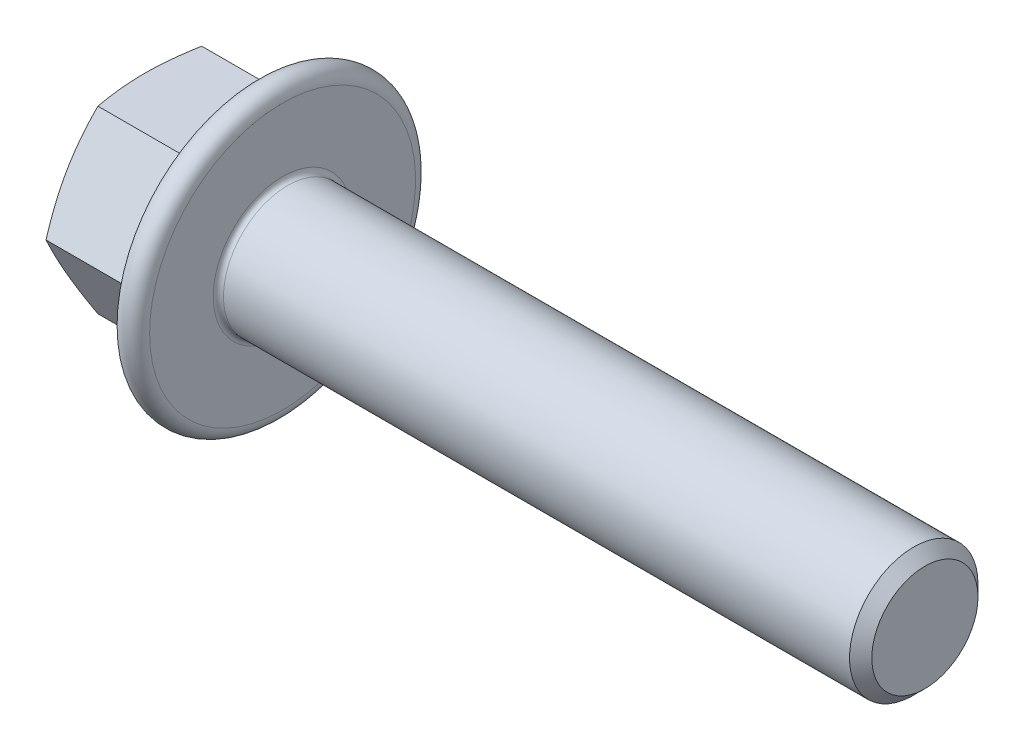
ISO-10303-21;
HEADER;
FILE_DESCRIPTION(('STEP AP214'),'2;1');
FILE_NAME('part.step','',(''),(''),'','','');
FILE_SCHEMA(('AUTOMOTIVE_DESIGN { 1 0 10303 214 1 1 1 1 }'));
ENDSEC;
DATA;
#1=APPLICATION_CONTEXT('core data for automotive mechanical design processes');
#2=APPLICATION_PROTOCOL_DEFINITION('international standard','automotive_design',2000,#1);
#3=PRODUCT_CONTEXT('',#1,'mechanical');
#4=PRODUCT('Part','Part','',(#3));
#5=PRODUCT_RELATED_PRODUCT_CATEGORY('part','',(#4));
#6=PRODUCT_DEFINITION_FORMATION('','',#4);
#7=PRODUCT_DEFINITION_CONTEXT('part definition',#1,'design');
#8=PRODUCT_DEFINITION('design','',#6,#7);
#9=PRODUCT_DEFINITION_SHAPE('','',#8);
#10=(LENGTH_UNIT() NAMED_UNIT(*) SI_UNIT(.MILLI.,.METRE.));
#11=(NAMED_UNIT(*) PLANE_ANGLE_UNIT() SI_UNIT($,.RADIAN.));
#12=(NAMED_UNIT(*) SI_UNIT($,.STERADIAN.) SOLID_ANGLE_UNIT());
#13=UNCERTAINTY_MEASURE_WITH_UNIT(LENGTH_MEASURE(1.E-05),#10,'distance_accuracy_value','');
#14=(GEOMETRIC_REPRESENTATION_CONTEXT(3) GLOBAL_UNCERTAINTY_ASSIGNED_CONTEXT((#13)) GLOBAL_UNIT_ASSIGNED_CONTEXT((#10,
#11,#12)) REPRESENTATION_CONTEXT('',''));
#15=CARTESIAN_POINT('',(0.,0.,0.));
#16=DIRECTION('',(0.,0.,1.));
#17=DIRECTION('',(1.,0.,0.));
#18=AXIS2_PLACEMENT_3D('',#15,#16,#17);
#19=CARTESIAN_POINT('',(5.6,-3.5,-2.02072594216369));
#20=DIRECTION('',(1.,0.,0.));
#21=DIRECTION('',(0.,0.,-1.));
#22=AXIS2_PLACEMENT_3D('',#19,#20,#21);
#23=PLANE('',#22);
#24=CARTESIAN_POINT('',(5.6,0.,0.));
#25=DIRECTION('',(1.,0.,0.));
#26=DIRECTION('',(0.,0.,-1.));
#27=AXIS2_PLACEMENT_3D('',#24,#25,#26);
#28=CIRCLE('',#27,2.7);
#29=CARTESIAN_POINT('',(5.6,0.,-2.7));
#30=VERTEX_POINT('',#29);
#31=EDGE_CURVE('E443',#30,#30,#28,.F.);
#32=ORIENTED_EDGE('',*,*,#31,.T.);
#33=EDGE_LOOP('',(#32));
#34=FACE_BOUND('',#33,.T.);
#35=CARTESIAN_POINT('',(5.6,0.,0.));
#36=DIRECTION('',(-1.,0.,0.));
#37=DIRECTION('',(0.,0.,1.));
#38=AXIS2_PLACEMENT_3D('',#35,#36,#37);
#39=CIRCLE('',#38,5.17542573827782);
#40=CARTESIAN_POINT('',(5.6,0.,5.17542573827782));
#41=VERTEX_POINT('',#40);
#42=EDGE_CURVE('E338',#41,#41,#39,.T.);
#43=ORIENTED_EDGE('',*,*,#42,.F.);
#44=EDGE_LOOP('',(#43));
#45=FACE_BOUND('',#44,.T.);
#46=ADVANCED_FACE('F33',(#34,#45),#23,.T.);
#47=CARTESIAN_POINT('',(30.6,0.,0.));
#48=DIRECTION('',(-1.,0.,0.));
#49=DIRECTION('',(0.,0.,1.));
#50=AXIS2_PLACEMENT_3D('',#47,#48,#49);
#51=CYLINDRICAL_SURFACE('',#50,2.5);
#52=CARTESIAN_POINT('',(30.167,0.,0.));
#53=DIRECTION('',(1.,0.,0.));
#54=DIRECTION('',(0.,0.,-1.));
#55=AXIS2_PLACEMENT_3D('',#52,#53,#54);
#56=CIRCLE('',#55,2.5);
#57=CARTESIAN_POINT('',(30.167,0.,-2.5));
#58=VERTEX_POINT('',#57);
#59=EDGE_CURVE('E11',#58,#58,#56,.F.);
#60=ORIENTED_EDGE('',*,*,#59,.T.);
#61=EDGE_LOOP('',(#60));
#62=FACE_BOUND('',#61,.T.);
#63=CARTESIAN_POINT('',(5.8,0.,0.));
#64=DIRECTION('',(1.,0.,0.));
#65=DIRECTION('',(0.,0.,-1.));
#66=AXIS2_PLACEMENT_3D('',#63,#64,#65);
#67=CIRCLE('',#66,2.5);
#68=CARTESIAN_POINT('',(5.8,0.,-2.5));
#69=VERTEX_POINT('',#68);
#70=EDGE_CURVE('E442',#69,#69,#67,.T.);
#71=ORIENTED_EDGE('',*,*,#70,.T.);
#72=EDGE_LOOP('',(#71));
#73=FACE_BOUND('',#72,.T.);
#74=ADVANCED_FACE('F321',(#62,#73),#51,.T.);
#75=CARTESIAN_POINT('',(30.6,0.,0.));
#76=DIRECTION('',(1.,0.,0.));
#77=DIRECTION('',(0.,0.,-1.));
#78=AXIS2_PLACEMENT_3D('',#75,#76,#77);
#79=PLANE('',#78);
#80=CARTESIAN_POINT('',(30.6,0.,0.));
#81=DIRECTION('',(1.,0.,0.));
#82=DIRECTION('',(0.,0.,-1.));
#83=AXIS2_PLACEMENT_3D('',#80,#81,#82);
#84=CIRCLE('',#83,2.067);
#85=CARTESIAN_POINT('',(30.6,0.,-2.067));
#86=VERTEX_POINT('',#85);
#87=EDGE_CURVE('E42',#86,#86,#84,.T.);
#88=ORIENTED_EDGE('',*,*,#87,.T.);
#89=EDGE_LOOP('',(#88));
#90=FACE_BOUND('',#89,.T.);
#91=ADVANCED_FACE('F153',(#90),#79,.T.);
#92=CARTESIAN_POINT('',(4.60000000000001,0.,0.));
#93=DIRECTION('',(1.,0.,0.));
#94=DIRECTION('',(0.,0.,-1.));
#95=AXIS2_PLACEMENT_3D('',#92,#93,#94);
#96=CONICAL_SURFACE('',#95,5.39712040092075,1.13446401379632);
#97=CARTESIAN_POINT('',(4.0464614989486,-4.45631914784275,1.46859482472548));
#98=CARTESIAN_POINT('',(4.2514438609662,-4.40374036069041,1.49895120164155));
#99=CARTESIAN_POINT('',(4.3183538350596,-4.48761495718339,1.68386176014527));
#100=CARTESIAN_POINT('',(4.00832912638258,-4.34478957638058,1.53298645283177));
#101=CARTESIAN_POINT('',(4.21255754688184,-4.29394882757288,1.5623393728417));
#102=CARTESIAN_POINT('',(4.28022146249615,-4.37698710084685,1.74585509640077));
#103=CARTESIAN_POINT('',(3.97146846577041,-4.23293378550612,1.59756642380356));
#104=CARTESIAN_POINT('',(4.17484567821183,-4.18368480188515,1.62600033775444));
#105=CARTESIAN_POINT('',(4.24336080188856,-4.26615106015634,1.80793369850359));
#106=CARTESIAN_POINT('',(3.90081434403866,-4.00845657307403,1.72716840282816));
#107=CARTESIAN_POINT('',(4.10251738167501,-3.96258066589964,1.75365487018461));
#108=CARTESIAN_POINT('',(4.17270668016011,-4.04400982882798,1.93234349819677));
#109=CARTESIAN_POINT('',(3.86702199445,-3.89583488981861,1.79219056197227));
#110=CARTESIAN_POINT('',(4.06788967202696,-3.85174377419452,1.81764657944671));
#111=CARTESIAN_POINT('',(4.13891433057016,-3.93270448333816,1.99467477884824));
#112=CARTESIAN_POINT('',(3.77081681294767,-3.55586386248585,1.98847292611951));
#113=CARTESIAN_POINT('',(3.96943570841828,-3.51809252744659,2.01028021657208));
#114=CARTESIAN_POINT('',(4.04270914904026,-3.59722897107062,2.18260573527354));
#115=CARTESIAN_POINT('',(3.71389117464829,-3.327303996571,2.1204320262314));
#116=CARTESIAN_POINT('',(3.91084938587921,-3.29360292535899,2.13988934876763));
#117=CARTESIAN_POINT('',(3.98578351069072,-3.37238851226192,2.30864509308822));
#118=CARTESIAN_POINT('',(3.62131247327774,-2.87332469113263,2.38253710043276));
#119=CARTESIAN_POINT('',(3.8156127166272,-2.84860825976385,2.39680713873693));
#120=CARTESIAN_POINT('',(3.89320480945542,-2.92758369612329,2.55890607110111));
#121=CARTESIAN_POINT('',(3.58511978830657,-2.64799053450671,2.51263383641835));
#122=CARTESIAN_POINT('',(3.77819495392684,-2.62780737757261,2.52428658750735));
#123=CARTESIAN_POINT('',(3.85701212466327,-2.70765432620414,2.68308301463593));
#124=CARTESIAN_POINT('',(3.53646331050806,-2.19579334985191,2.77371000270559));
#125=CARTESIAN_POINT('',(3.72803794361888,-2.18578045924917,2.77949094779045));
#126=CARTESIAN_POINT('',(3.80835564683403,-2.26797810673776,2.93307795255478));
#127=CARTESIAN_POINT('',(3.52394934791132,-1.96893457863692,2.90468697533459));
#128=CARTESIAN_POINT('',(3.71506145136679,-1.96377655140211,2.9076649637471));
#129=CARTESIAN_POINT('',(3.79584168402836,-2.04823185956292,3.05889190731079));
#130=CARTESIAN_POINT('',(3.52453410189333,-1.5160880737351,3.16613802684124));
#131=CARTESIAN_POINT('',(3.71566446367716,-1.52158650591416,3.16296350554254));
#132=CARTESIAN_POINT('',(3.7964264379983,-1.61050537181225,3.31166149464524));
#133=CARTESIAN_POINT('',(3.53753770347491,-1.29010023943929,3.29661216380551));
#134=CARTESIAN_POINT('',(3.72914784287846,-1.30043460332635,3.29064561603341));
#135=CARTESIAN_POINT('',(3.80943003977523,-1.39252160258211,3.43861113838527));
#136=CARTESIAN_POINT('',(3.58692150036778,-0.839663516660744,3.55667192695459));
#137=CARTESIAN_POINT('',(3.78005348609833,-0.860110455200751,3.54486688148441));
#138=CARTESIAN_POINT('',(3.85881383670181,-0.95787573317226,3.69345795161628));
#139=CARTESIAN_POINT('',(3.62335108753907,-0.615218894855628,3.68625508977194));
#140=CARTESIAN_POINT('',(3.81771231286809,-0.640176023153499,3.67184608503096));
#141=CARTESIAN_POINT('',(3.8952434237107,-0.741217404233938,3.82135655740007));
#142=CARTESIAN_POINT('',(3.71618077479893,-0.163047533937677,3.94731634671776));
#143=CARTESIAN_POINT('',(3.91320318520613,-0.196931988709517,3.92775314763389));
#144=CARTESIAN_POINT('',(3.98807311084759,-0.303803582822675,4.08044783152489));
#145=CARTESIAN_POINT('',(3.77311238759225,0.0645946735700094,4.07874563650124));
#146=CARTESIAN_POINT('',(3.97179099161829,0.0266635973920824,4.05684611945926));
#147=CARTESIAN_POINT('',(4.04500472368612,-0.0831036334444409,4.21163226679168));
#148=CARTESIAN_POINT('',(3.86920183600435,0.403214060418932,4.27424763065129));
#149=CARTESIAN_POINT('',(4.0701232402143,0.359002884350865,4.2487222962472));
#150=CARTESIAN_POINT('',(4.14109417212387,0.24609380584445,4.40743123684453));
#151=CARTESIAN_POINT('',(3.90293524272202,0.51539070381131,4.33901284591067));
#152=CARTESIAN_POINT('',(4.10468919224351,0.469405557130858,4.31246330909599));
#153=CARTESIAN_POINT('',(4.1748275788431,0.355300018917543,4.47240507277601));
#154=CARTESIAN_POINT('',(3.97343816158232,0.738985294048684,4.46810524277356));
#155=CARTESIAN_POINT('',(4.17686034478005,0.68964707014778,4.43961980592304));
#156=CARTESIAN_POINT('',(4.2453304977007,0.573263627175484,4.60207451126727));
#157=CARTESIAN_POINT('',(4.0102065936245,0.850403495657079,4.53243257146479));
#158=CARTESIAN_POINT('',(4.21447659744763,0.799482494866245,4.5030333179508));
#159=CARTESIAN_POINT('',(4.28209892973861,0.682021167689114,4.66677020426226));
#160=CARTESIAN_POINT('',(4.04823384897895,0.96149842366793,4.59657325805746));
#161=CARTESIAN_POINT('',(4.25325515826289,0.908849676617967,4.56617648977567));
#162=CARTESIAN_POINT('',(4.32012618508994,0.790602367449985,4.73132924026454));
#163=(BOUNDED_SURFACE() B_SPLINE_SURFACE(3,2,((#97,#98,#99),(#100,#101,#102),(#103,#104,#105),
(#106,#107,#108),(#109,#110,#111),(#112,#113,#114),(#115,#116,#117),(#118,#119,#120),(#121,#122,
#123),(#124,#125,#126),(#127,#128,#129),(#130,#131,#132),(#133,#134,#135),(#136,#137,#138),
(#139,#140,#141),(#142,#143,#144),(#145,#146,#147),(#148,#149,#150),(#151,#152,#153),(#154,#155,
#156),(#157,#158,#159),(#160,#161,#162)),.UNSPECIFIED.,.F.,.F.,
.F.) B_SPLINE_SURFACE_WITH_KNOTS((4,2,2,2,2,2,2,2,2,2,4),(3,3),(0.,0.402917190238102,
0.805979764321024,1.61534420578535,2.40255476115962,3.18809552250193,3.97071379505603,
4.75498759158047,5.56126038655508,5.96278688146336,6.36417109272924),(0.,1.),
.UNSPECIFIED.) GEOMETRIC_REPRESENTATION_ITEM() RATIONAL_B_SPLINE_SURFACE(((1.,0.814376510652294,
1.),(1.,0.81604058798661,1.),(1.,0.817730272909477,1.),(1.,0.821115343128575,1.),(1.,
0.822810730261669,1.),(1.,0.827848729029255,1.),(1.,0.831129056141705,1.),(1.,0.836794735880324,
1.),(1.,0.839202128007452,1.),(1.,0.842509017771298,1.),(1.,0.843411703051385,1.),(1.,
0.843370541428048,1.),(1.,0.842433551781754,1.),(1.,0.839081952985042,1.),(1.,0.836664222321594,
1.),(1.,0.830994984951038,1.),(1.,0.827721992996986,1.),(1.,0.822700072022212,1.),(1.,
0.821010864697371,1.),(1.,0.817638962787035,1.),(1.,0.815956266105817,1.),(1.,0.81429915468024,1.))) REPRESENTATION_ITEM('') SURFACE());
#164=CARTESIAN_POINT('',(4.32012618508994,0.790602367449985,4.73132924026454));
#165=CARTESIAN_POINT('',(4.28209892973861,0.682021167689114,4.66677020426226));
#166=CARTESIAN_POINT('',(4.2453304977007,0.573263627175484,4.60207451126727));
#167=CARTESIAN_POINT('',(4.1748275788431,0.355300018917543,4.47240507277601));
#168=CARTESIAN_POINT('',(4.14109417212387,0.24609380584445,4.40743123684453));
#169=CARTESIAN_POINT('',(4.04500472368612,-0.0831036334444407,4.21163226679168));
#170=CARTESIAN_POINT('',(3.98807311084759,-0.303803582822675,4.08044783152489));
#171=CARTESIAN_POINT('',(3.8952434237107,-0.741217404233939,3.82135655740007));
#172=CARTESIAN_POINT('',(3.85881383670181,-0.957875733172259,3.69345795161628));
#173=CARTESIAN_POINT('',(3.80943003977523,-1.39252160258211,3.43861113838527));
#174=CARTESIAN_POINT('',(3.7964264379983,-1.61050537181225,3.31166149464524));
#175=CARTESIAN_POINT('',(3.79584168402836,-2.04823185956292,3.05889190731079));
#176=CARTESIAN_POINT('',(3.80835564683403,-2.26797810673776,2.93307795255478));
#177=CARTESIAN_POINT('',(3.85701212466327,-2.70765432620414,2.68308301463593));
#178=CARTESIAN_POINT('',(3.89320480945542,-2.92758369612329,2.55890607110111));
#179=CARTESIAN_POINT('',(3.98578351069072,-3.37238851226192,2.30864509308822));
#180=CARTESIAN_POINT('',(4.04270914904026,-3.59722897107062,2.18260573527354));
#181=CARTESIAN_POINT('',(4.13891433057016,-3.93270448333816,1.99467477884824));
#182=CARTESIAN_POINT('',(4.17270668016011,-4.04400982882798,1.93234349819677));
#183=CARTESIAN_POINT('',(4.24336080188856,-4.26615106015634,1.80793369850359));
#184=CARTESIAN_POINT('',(4.28022146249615,-4.37698710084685,1.74585509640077));
#185=CARTESIAN_POINT('',(4.3183538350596,-4.48761495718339,1.68386176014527));
#186=B_SPLINE_CURVE_WITH_KNOTS('',3,(#164,#165,#166,#167,#168,#169,#170,#171,#172,#173,#174,
#175,#176,#177,#178,#179,#180,#181,#182,#183,#184,#185),.UNSPECIFIED.,.F.,.F.,(4,2,2,2,2,2,2,2,
2,2,4),(0.,0.401384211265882,0.802910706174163,1.60918350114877,2.39345729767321,
3.17607557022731,3.96161633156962,4.74882688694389,5.55819132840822,5.96125390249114,
6.36417109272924),.UNSPECIFIED.);
#187=CARTESIAN_POINT('',(4.07025406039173,0.,4.26107656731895));
#188=VERTEX_POINT('',#187);
#189=CARTESIAN_POINT('',(4.07025406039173,-3.6902005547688,2.13053828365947));
#190=VERTEX_POINT('',#189);
#191=EDGE_CURVE('E456',#188,#190,#186,.T.);
#192=ORIENTED_EDGE('',*,*,#191,.T.);
#193=CARTESIAN_POINT('',(4.04181547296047,-3.5,-3.10927835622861));
#194=CARTESIAN_POINT('',(4.24669552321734,-3.5,-3.0487784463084));
#195=CARTESIAN_POINT('',(4.31370780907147,-3.7018758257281,-3.02899010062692));
#196=CARTESIAN_POINT('',(4.00410090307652,-3.5,-2.98152262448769));
#197=CARTESIAN_POINT('',(4.20823209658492,-3.5,-2.92301922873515));
#198=CARTESIAN_POINT('',(4.27599323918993,-3.70026096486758,-2.90321057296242));
#199=CARTESIAN_POINT('',(3.9676465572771,-3.5,-2.85339473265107));
#200=CARTESIAN_POINT('',(4.17093369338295,-3.5,-2.79672157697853));
#201=CARTESIAN_POINT('',(4.23953889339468,-3.69861693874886,-2.77721106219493));
#202=CARTESIAN_POINT('',(3.89777177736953,-3.5,-2.59626780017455));
#203=CARTESIAN_POINT('',(4.09939932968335,-3.5,-2.54347135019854));
#204=CARTESIAN_POINT('',(4.16966411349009,-3.69531471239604,-2.52468792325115));
#205=CARTESIAN_POINT('',(3.86435242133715,-3.5,-2.46726846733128));
#206=CARTESIAN_POINT('',(4.06515216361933,-3.5,-2.41652197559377));
#207=CARTESIAN_POINT('',(4.1362447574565,-3.69365650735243,-2.39816412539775));
#208=CARTESIAN_POINT('',(3.76920723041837,-3.5,-2.07788853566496));
#209=CARTESIAN_POINT('',(3.96777737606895,-3.5,-2.03438901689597));
#210=CARTESIAN_POINT('',(4.04109956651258,-3.68871572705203,-2.0168143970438));
#211=CARTESIAN_POINT('',(3.71290007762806,-3.5,-1.81613207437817));
#212=CARTESIAN_POINT('',(3.90982730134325,-3.5,-1.77730140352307));
#213=CARTESIAN_POINT('',(3.98479241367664,-3.68548042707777,-1.76120129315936));
#214=CARTESIAN_POINT('',(3.6212229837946,-3.5,-1.29617527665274));
#215=CARTESIAN_POINT('',(3.81551709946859,-3.5,-1.26764256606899));
#216=CARTESIAN_POINT('',(3.89311531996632,-3.67986244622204,-1.25501055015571));
#217=CARTESIAN_POINT('',(3.58532717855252,-3.5,-1.0380706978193));
#218=CARTESIAN_POINT('',(3.77840857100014,-3.5,-1.01473559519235));
#219=CARTESIAN_POINT('',(3.85721951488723,-3.67745904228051,-1.00448408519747));
#220=CARTESIAN_POINT('',(3.53686491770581,-3.5,-0.520112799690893));
#221=CARTESIAN_POINT('',(3.72845147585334,-3.5,-0.508421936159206));
#222=CARTESIAN_POINT('',(3.80875725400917,-3.67413706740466,-0.502770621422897));
#223=CARTESIAN_POINT('',(3.52425011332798,-3.5,-0.26026423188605));
#224=CARTESIAN_POINT('',(3.7153715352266,-3.5,-0.254140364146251));
#225=CARTESIAN_POINT('',(3.79614244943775,-3.67321541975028,-0.251586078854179));
#226=CARTESIAN_POINT('',(3.52422417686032,-3.5,0.260069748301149));
#227=CARTESIAN_POINT('',(3.71534491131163,-3.5,0.253949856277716));
#228=CARTESIAN_POINT('',(3.79611651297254,-3.67321362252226,0.251398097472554));
#229=CARTESIAN_POINT('',(3.53687469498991,-3.5,0.520555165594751));
#230=CARTESIAN_POINT('',(3.72846210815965,-3.5,0.508856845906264));
#231=CARTESIAN_POINT('',(3.80876703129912,-3.67413797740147,0.503197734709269));
#232=CARTESIAN_POINT('',(3.58551867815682,-3.5,1.03977602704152));
#233=CARTESIAN_POINT('',(3.77860620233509,-3.5,1.01640618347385));
#234=CARTESIAN_POINT('',(3.85741101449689,-3.67747195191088,1.00613730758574));
#235=CARTESIAN_POINT('',(3.62156095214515,-3.5,1.2985066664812));
#236=CARTESIAN_POINT('',(3.81586646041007,-3.5,1.26992943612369));
#237=CARTESIAN_POINT('',(3.89345328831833,-3.6798846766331,1.25727475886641));
#238=CARTESIAN_POINT('',(3.713611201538,-3.5,1.81973253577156));
#239=CARTESIAN_POINT('',(3.91055956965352,-3.5,1.78083875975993));
#240=CARTESIAN_POINT('',(3.98550353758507,-3.68552246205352,1.76471215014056));
#241=CARTESIAN_POINT('',(3.77014847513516,-3.5,2.08213121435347));
#242=CARTESIAN_POINT('',(3.96874567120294,-3.5,2.03856114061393));
#243=CARTESIAN_POINT('',(4.04204081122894,-3.68876832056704,2.02096048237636));
#244=CARTESIAN_POINT('',(3.86566930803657,-3.5,2.47245798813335));
#245=CARTESIAN_POINT('',(4.0665023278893,-3.5,2.42162908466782));
#246=CARTESIAN_POINT('',(4.13756164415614,-3.69372294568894,2.40325134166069));
#247=CARTESIAN_POINT('',(3.8992182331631,-3.5,2.60176815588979));
#248=CARTESIAN_POINT('',(4.10088144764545,-3.5,2.54888710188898));
#249=CARTESIAN_POINT('',(4.17111056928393,-3.69538540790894,2.53008488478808));
#250=CARTESIAN_POINT('',(3.96935953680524,-3.5,2.85951324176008));
#251=CARTESIAN_POINT('',(4.17268686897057,-3.5,2.80275218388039));
#252=CARTESIAN_POINT('',(4.24125187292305,-3.6986954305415,2.7832251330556));
#253=CARTESIAN_POINT('',(4.00595082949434,-3.5,2.98794845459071));
#254=CARTESIAN_POINT('',(4.21012437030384,-3.5,2.92935582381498));
#255=CARTESIAN_POINT('',(4.27784316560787,-3.70034299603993,2.90953200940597));
#256=CARTESIAN_POINT('',(4.04380467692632,-3.5,3.11601033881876));
#257=CARTESIAN_POINT('',(4.24872857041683,-3.5,3.05541910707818));
#258=CARTESIAN_POINT('',(4.31569701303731,-3.70196100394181,3.03561809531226));
#259=(BOUNDED_SURFACE() B_SPLINE_SURFACE(3,2,((#193,#194,#195),(#196,#197,#198),(#199,#200,
#201),(#202,#203,#204),(#205,#206,#207),(#208,#209,#210),(#211,#212,#213),(#214,#215,#216),
(#217,#218,#219),(#220,#221,#222),(#223,#224,#225),(#226,#227,#228),(#229,#230,#231),(#232,#233,
#234),(#235,#236,#237),(#238,#239,#240),(#241,#242,#243),(#244,#245,#246),(#247,#248,#249),
(#250,#251,#252),(#253,#254,#255),(#256,#257,#258)),.UNSPECIFIED.,.F.,.F.,
.F.) B_SPLINE_SURFACE_WITH_KNOTS((4,2,2,2,2,2,2,2,2,2,4),(3,3),(0.,0.399605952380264,
0.799353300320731,1.60199898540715,2.38290112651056,3.16217969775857,3.94336211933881,
4.72617980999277,5.53085166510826,5.93159918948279,6.33220429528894),(0.,1.),
.UNSPECIFIED.) GEOMETRIC_REPRESENTATION_ITEM() RATIONAL_B_SPLINE_SURFACE(((1.,0.814579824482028,
1.),(1.,0.81623196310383,1.),(1.,0.817908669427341,1.),(1.,0.821266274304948,1.),(1.,
0.822947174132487,1.),(1.,0.827939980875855,1.),(1.,0.831188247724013,1.),(1.,0.83680168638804,
1.),(1.,0.839188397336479,1.),(1.,0.84248129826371,1.),(1.,0.843390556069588,1.),(1.,
0.843392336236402,1.),(1.,0.842480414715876,1.),(1.,0.839175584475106,1.),(1.,0.836779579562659,
1.),(1.,0.83114613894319,1.),(1.,0.827887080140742,1.),(1.,0.822879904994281,1.),(1.,
0.821194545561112,1.),(1.,0.817828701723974,1.),(1.,0.81614821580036,1.),(1.,0.814492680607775,1.))) REPRESENTATION_ITEM('') SURFACE());
#260=CARTESIAN_POINT('',(4.31569701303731,-3.70196100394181,3.03561809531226));
#261=CARTESIAN_POINT('',(4.27784316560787,-3.70034299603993,2.90953200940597));
#262=CARTESIAN_POINT('',(4.24125187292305,-3.6986954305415,2.7832251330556));
#263=CARTESIAN_POINT('',(4.17111056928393,-3.69538540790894,2.53008488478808));
#264=CARTESIAN_POINT('',(4.13756164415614,-3.69372294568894,2.40325134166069));
#265=CARTESIAN_POINT('',(4.04204081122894,-3.68876832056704,2.02096048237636));
#266=CARTESIAN_POINT('',(3.98550353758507,-3.68552246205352,1.76471215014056));
#267=CARTESIAN_POINT('',(3.89345328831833,-3.6798846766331,1.25727475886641));
#268=CARTESIAN_POINT('',(3.85741101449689,-3.67747195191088,1.00613730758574));
#269=CARTESIAN_POINT('',(3.80876703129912,-3.67413797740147,0.503197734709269));
#270=CARTESIAN_POINT('',(3.79611651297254,-3.67321362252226,0.251398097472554));
#271=CARTESIAN_POINT('',(3.79614244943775,-3.67321541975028,-0.251586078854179));
#272=CARTESIAN_POINT('',(3.80875725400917,-3.67413706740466,-0.502770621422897));
#273=CARTESIAN_POINT('',(3.85721951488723,-3.67745904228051,-1.00448408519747));
#274=CARTESIAN_POINT('',(3.89311531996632,-3.67986244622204,-1.25501055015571));
#275=CARTESIAN_POINT('',(3.98479241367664,-3.68548042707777,-1.76120129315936));
#276=CARTESIAN_POINT('',(4.04109956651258,-3.68871572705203,-2.0168143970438));
#277=CARTESIAN_POINT('',(4.1362447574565,-3.69365650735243,-2.39816412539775));
#278=CARTESIAN_POINT('',(4.16966411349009,-3.69531471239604,-2.52468792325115));
#279=CARTESIAN_POINT('',(4.23953889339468,-3.69861693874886,-2.77721106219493));
#280=CARTESIAN_POINT('',(4.27599323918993,-3.70026096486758,-2.90321057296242));
#281=CARTESIAN_POINT('',(4.31370780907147,-3.7018758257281,-3.02899010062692));
#282=B_SPLINE_CURVE_WITH_KNOTS('',3,(#260,#261,#262,#263,#264,#265,#266,#267,#268,#269,#270,
#271,#272,#273,#274,#275,#276,#277,#278,#279,#280,#281),.UNSPECIFIED.,.F.,.F.,(4,2,2,2,2,2,2,2,
2,2,4),(0.,0.40060510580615,0.801352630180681,1.60602448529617,2.38884217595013,
3.17002459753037,3.94930316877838,4.7302053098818,5.53285099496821,5.93259834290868,
6.33220429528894),.UNSPECIFIED.);
#283=CARTESIAN_POINT('',(4.07025406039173,-3.6902005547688,-2.13053828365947));
#284=VERTEX_POINT('',#283);
#285=EDGE_CURVE('E385',#190,#284,#282,.T.);
#286=ORIENTED_EDGE('',*,*,#285,.T.);
#287=CARTESIAN_POINT('',(4.0464614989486,0.956319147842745,-4.59358300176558));
#288=CARTESIAN_POINT('',(4.2514438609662,0.903740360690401,-4.56322662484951));
#289=CARTESIAN_POINT('',(4.3183538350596,0.785540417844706,-4.72831943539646));
#290=CARTESIAN_POINT('',(4.00832912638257,0.844789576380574,-4.52919137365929));
#291=CARTESIAN_POINT('',(4.21255754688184,0.793948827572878,-4.49983845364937));
#292=CARTESIAN_POINT('',(4.28022146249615,0.676538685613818,-4.66350956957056));
#293=CARTESIAN_POINT('',(3.9714684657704,0.732933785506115,-4.46461140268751));
#294=CARTESIAN_POINT('',(4.17484567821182,0.683684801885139,-4.43617748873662));
#295=CARTESIAN_POINT('',(4.24336080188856,0.567359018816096,-4.5985620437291));
#296=CARTESIAN_POINT('',(3.90081434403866,0.508456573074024,-4.3350094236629));
#297=CARTESIAN_POINT('',(4.10251738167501,0.462580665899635,-4.30852295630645));
#298=CARTESIAN_POINT('',(4.17270668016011,0.34854635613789,-4.46838699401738));
#299=CARTESIAN_POINT('',(3.86702199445,0.395834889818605,-4.2699872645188));
#300=CARTESIAN_POINT('',(4.06788967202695,0.351743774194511,-4.24453124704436));
#301=CARTESIAN_POINT('',(4.13891433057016,0.23891321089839,-4.40315937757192));
#302=CARTESIAN_POINT('',(3.77081681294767,0.0558638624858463,-4.07370490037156));
#303=CARTESIAN_POINT('',(3.96943570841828,0.01809252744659,-4.05189760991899));
#304=CARTESIAN_POINT('',(4.04270914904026,-0.0915775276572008,-4.20659453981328));
#305=CARTESIAN_POINT('',(3.71389117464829,-0.172696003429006,-3.94174580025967));
#306=CARTESIAN_POINT('',(3.91084938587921,-0.20639707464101,-3.92228847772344));
#307=CARTESIAN_POINT('',(3.98578351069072,-0.31315104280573,-4.07489666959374));
#308=CARTESIAN_POINT('',(3.62131247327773,-0.626675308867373,-3.67964072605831));
#309=CARTESIAN_POINT('',(3.8156127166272,-0.65139174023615,-3.66537068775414));
#310=CARTESIAN_POINT('',(3.89320480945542,-0.75228581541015,-3.81481488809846));
#311=CARTESIAN_POINT('',(3.58511978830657,-0.852009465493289,-3.54954399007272));
#312=CARTESIAN_POINT('',(3.77819495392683,-0.872192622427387,-3.53789123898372));
#313=CARTESIAN_POINT('',(3.85701212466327,-0.96979088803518,-3.68643893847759));
#314=CARTESIAN_POINT('',(3.53646331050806,-1.30420665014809,-3.28846782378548));
#315=CARTESIAN_POINT('',(3.72803794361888,-1.31421954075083,-3.28268687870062));
#316=CARTESIAN_POINT('',(3.80835564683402,-1.4061309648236,-3.43066563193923));
#317=CARTESIAN_POINT('',(3.52394934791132,-1.53106542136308,-3.15749085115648));
#318=CARTESIAN_POINT('',(3.71506145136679,-1.53622344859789,-3.15451286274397));
#319=CARTESIAN_POINT('',(3.79584168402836,-1.62496216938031,-3.30326677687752));
#320=CARTESIAN_POINT('',(3.52453410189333,-1.9839119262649,-2.89603979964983));
#321=CARTESIAN_POINT('',(3.71566446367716,-1.97841349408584,-2.89921432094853));
#322=CARTESIAN_POINT('',(3.7964264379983,-2.0627302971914,-3.05056931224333));
#323=CARTESIAN_POINT('',(3.5375377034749,-2.20989976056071,-2.76556566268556));
#324=CARTESIAN_POINT('',(3.72914784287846,-2.19956539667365,-2.77153221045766));
#325=CARTESIAN_POINT('',(3.80943003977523,-2.28166379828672,-2.92526465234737));
#326=CARTESIAN_POINT('',(3.58692150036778,-2.66033648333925,-2.50550589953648));
#327=CARTESIAN_POINT('',(3.78005348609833,-2.63988954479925,-2.51731094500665));
#328=CARTESIAN_POINT('',(3.85881383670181,-2.7196905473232,-2.67627369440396));
#329=CARTESIAN_POINT('',(3.62335108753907,-2.88478110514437,-2.37592273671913));
#330=CARTESIAN_POINT('',(3.81771231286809,-2.8598239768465,-2.39033174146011));
#331=CARTESIAN_POINT('',(3.8952434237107,-2.93878315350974,-2.55259138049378));
#332=CARTESIAN_POINT('',(3.71618077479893,-3.33695246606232,-2.11486147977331));
#333=CARTESIAN_POINT('',(3.91320318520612,-3.30306801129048,-2.13442467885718));
#334=CARTESIAN_POINT('',(3.98807311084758,-3.38186968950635,-2.30332553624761));
#335=CARTESIAN_POINT('',(3.77311238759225,-3.56459467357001,-1.98343218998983));
#336=CARTESIAN_POINT('',(3.97179099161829,-3.52666359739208,-2.00533170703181));
#337=CARTESIAN_POINT('',(4.04500472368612,-3.60582871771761,-2.17778599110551));
#338=CARTESIAN_POINT('',(3.86920183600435,-3.90321406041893,-1.78793019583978));
#339=CARTESIAN_POINT('',(4.0701232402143,-3.85900288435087,-1.81345553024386));
#340=CARTESIAN_POINT('',(4.14109417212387,-3.93999431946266,-1.99059213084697));
#341=CARTESIAN_POINT('',(3.90293524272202,-4.01539070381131,-1.7231649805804));
#342=CARTESIAN_POINT('',(4.10468919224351,-3.96940555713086,-1.74971451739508));
#343=CARTESIAN_POINT('',(4.1748275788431,-4.05086641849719,-1.92850369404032));
#344=CARTESIAN_POINT('',(3.97343816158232,-4.23898529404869,-1.5940725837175));
#345=CARTESIAN_POINT('',(4.17686034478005,-4.18964707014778,-1.62255802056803));
#346=CARTESIAN_POINT('',(4.24533049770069,-4.27214525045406,-1.80457639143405));
#347=CARTESIAN_POINT('',(4.01020659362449,-4.35040349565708,-1.52974525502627));
#348=CARTESIAN_POINT('',(4.21447659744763,-4.29948249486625,-1.55914450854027));
#349=CARTESIAN_POINT('',(4.28209892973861,-4.38255213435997,-1.74273744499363));
#350=CARTESIAN_POINT('',(4.04823384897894,-4.46149842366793,-1.46560456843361));
#351=CARTESIAN_POINT('',(4.25325515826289,-4.40884967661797,-1.4960013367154));
#352=CARTESIAN_POINT('',(4.32012618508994,-4.49275249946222,-1.68098288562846));
#353=(BOUNDED_SURFACE() B_SPLINE_SURFACE(3,2,((#287,#288,#289),(#290,#291,#292),(#293,#294,
#295),(#296,#297,#298),(#299,#300,#301),(#302,#303,#304),(#305,#306,#307),(#308,#309,#310),
(#311,#312,#313),(#314,#315,#316),(#317,#318,#319),(#320,#321,#322),(#323,#324,#325),(#326,#327,
#328),(#329,#330,#331),(#332,#333,#334),(#335,#336,#337),(#338,#339,#340),(#341,#342,#343),
(#344,#345,#346),(#347,#348,#349),(#350,#351,#352)),.UNSPECIFIED.,.F.,.F.,
.F.) B_SPLINE_SURFACE_WITH_KNOTS((4,2,2,2,2,2,2,2,2,2,4),(3,3),(0.,0.402917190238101,
0.805979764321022,1.61534420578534,2.40255476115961,3.18809552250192,3.97071379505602,
4.75498759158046,5.56126038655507,5.96278688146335,6.36417109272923),(0.,1.),
.UNSPECIFIED.) GEOMETRIC_REPRESENTATION_ITEM() RATIONAL_B_SPLINE_SURFACE(((1.,0.814376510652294,
1.),(1.,0.81604058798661,1.),(1.,0.817730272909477,1.),(1.,0.821115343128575,1.),(1.,
0.822810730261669,1.),(1.,0.827848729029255,1.),(1.,0.831129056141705,1.),(1.,0.836794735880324,
1.),(1.,0.839202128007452,1.),(1.,0.842509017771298,1.),(1.,0.843411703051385,1.),(1.,
0.843370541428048,1.),(1.,0.842433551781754,1.),(1.,0.839081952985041,1.),(1.,0.836664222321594,
1.),(1.,0.830994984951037,1.),(1.,0.827721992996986,1.),(1.,0.822700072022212,1.),(1.,
0.821010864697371,1.),(1.,0.817638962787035,1.),(1.,0.815956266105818,1.),(1.,0.81429915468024,1.))) REPRESENTATION_ITEM('') SURFACE());
#354=CARTESIAN_POINT('',(4.32012618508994,-4.49275249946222,-1.68098288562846));
#355=CARTESIAN_POINT('',(4.28209892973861,-4.38255213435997,-1.74273744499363));
#356=CARTESIAN_POINT('',(4.24533049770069,-4.27214525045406,-1.80457639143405));
#357=CARTESIAN_POINT('',(4.1748275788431,-4.05086641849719,-1.92850369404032));
#358=CARTESIAN_POINT('',(4.14109417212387,-3.93999431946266,-1.99059213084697));
#359=CARTESIAN_POINT('',(4.04500472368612,-3.60582871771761,-2.17778599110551));
#360=CARTESIAN_POINT('',(3.98807311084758,-3.38186968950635,-2.30332553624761));
#361=CARTESIAN_POINT('',(3.8952434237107,-2.93878315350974,-2.55259138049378));
#362=CARTESIAN_POINT('',(3.85881383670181,-2.7196905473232,-2.67627369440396));
#363=CARTESIAN_POINT('',(3.80943003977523,-2.28166379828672,-2.92526465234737));
#364=CARTESIAN_POINT('',(3.7964264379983,-2.0627302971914,-3.05056931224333));
#365=CARTESIAN_POINT('',(3.79584168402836,-1.62496216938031,-3.30326677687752));
#366=CARTESIAN_POINT('',(3.80835564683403,-1.4061309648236,-3.43066563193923));
#367=CARTESIAN_POINT('',(3.85701212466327,-0.96979088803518,-3.68643893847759));
#368=CARTESIAN_POINT('',(3.89320480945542,-0.75228581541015,-3.81481488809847));
#369=CARTESIAN_POINT('',(3.98578351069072,-0.31315104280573,-4.07489666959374));
#370=CARTESIAN_POINT('',(4.04270914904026,-0.0915775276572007,-4.20659453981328));
#371=CARTESIAN_POINT('',(4.13891433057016,0.23891321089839,-4.40315937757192));
#372=CARTESIAN_POINT('',(4.17270668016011,0.34854635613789,-4.46838699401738));
#373=CARTESIAN_POINT('',(4.24336080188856,0.567359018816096,-4.5985620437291));
#374=CARTESIAN_POINT('',(4.28022146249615,0.676538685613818,-4.66350956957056));
#375=CARTESIAN_POINT('',(4.3183538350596,0.785540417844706,-4.72831943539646));
#376=B_SPLINE_CURVE_WITH_KNOTS('',3,(#354,#355,#356,#357,#358,#359,#360,#361,#362,#363,#364,
#365,#366,#367,#368,#369,#370,#371,#372,#373,#374,#375),.UNSPECIFIED.,.F.,.F.,(4,2,2,2,2,2,2,2,
2,2,4),(0.,0.401384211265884,0.802910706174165,1.60918350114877,2.39345729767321,
3.17607557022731,3.96161633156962,4.74882688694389,5.55819132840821,5.96125390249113,
6.36417109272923),.UNSPECIFIED.);
#377=CARTESIAN_POINT('',(4.07025406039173,0.,-4.26107656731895));
#378=VERTEX_POINT('',#377);
#379=EDGE_CURVE('E393',#284,#378,#376,.T.);
#380=ORIENTED_EDGE('',*,*,#379,.T.);
#381=CARTESIAN_POINT('',(4.04646149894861,4.45631914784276,-1.46859482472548));
#382=CARTESIAN_POINT('',(4.2514438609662,4.40374036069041,-1.49895120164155));
#383=CARTESIAN_POINT('',(4.3183538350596,4.4876149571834,-1.68386176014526));
#384=CARTESIAN_POINT('',(4.00832912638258,4.34478957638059,-1.53298645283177));
#385=CARTESIAN_POINT('',(4.21255754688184,4.29394882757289,-1.56233937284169));
#386=CARTESIAN_POINT('',(4.28022146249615,4.37698710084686,-1.74585509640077));
#387=CARTESIAN_POINT('',(3.9714684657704,4.23293378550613,-1.59756642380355));
#388=CARTESIAN_POINT('',(4.17484567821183,4.18368480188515,-1.62600033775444));
#389=CARTESIAN_POINT('',(4.24336080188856,4.26615106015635,-1.80793369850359));
#390=CARTESIAN_POINT('',(3.90081434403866,4.00845657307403,-1.72716840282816));
#391=CARTESIAN_POINT('',(4.10251738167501,3.96258066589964,-1.75365487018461));
#392=CARTESIAN_POINT('',(4.17270668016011,4.04400982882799,-1.93234349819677));
#393=CARTESIAN_POINT('',(3.86702199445,3.89583488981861,-1.79219056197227));
#394=CARTESIAN_POINT('',(4.06788967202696,3.85174377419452,-1.81764657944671));
#395=CARTESIAN_POINT('',(4.13891433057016,3.93270448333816,-1.99467477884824));
#396=CARTESIAN_POINT('',(3.77081681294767,3.55586386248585,-1.98847292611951));
#397=CARTESIAN_POINT('',(3.96943570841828,3.5180925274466,-2.01028021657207));
#398=CARTESIAN_POINT('',(4.04270914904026,3.59722897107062,-2.18260573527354));
#399=CARTESIAN_POINT('',(3.71389117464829,3.327303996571,-2.12043202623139));
#400=CARTESIAN_POINT('',(3.91084938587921,3.293602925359,-2.13988934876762));
#401=CARTESIAN_POINT('',(3.98578351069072,3.37238851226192,-2.30864509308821));
#402=CARTESIAN_POINT('',(3.62131247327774,2.87332469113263,-2.38253710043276));
#403=CARTESIAN_POINT('',(3.8156127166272,2.84860825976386,-2.39680713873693));
#404=CARTESIAN_POINT('',(3.89320480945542,2.92758369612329,-2.55890607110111));
#405=CARTESIAN_POINT('',(3.58511978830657,2.64799053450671,-2.51263383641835));
#406=CARTESIAN_POINT('',(3.77819495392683,2.62780737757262,-2.52428658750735));
#407=CARTESIAN_POINT('',(3.85701212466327,2.70765432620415,-2.68308301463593));
#408=CARTESIAN_POINT('',(3.53646331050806,2.19579334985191,-2.77371000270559));
#409=CARTESIAN_POINT('',(3.72803794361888,2.18578045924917,-2.77949094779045));
#410=CARTESIAN_POINT('',(3.80835564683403,2.26797810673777,-2.93307795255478));
#411=CARTESIAN_POINT('',(3.52394934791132,1.96893457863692,-2.90468697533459));
#412=CARTESIAN_POINT('',(3.71506145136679,1.96377655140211,-2.9076649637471));
#413=CARTESIAN_POINT('',(3.79584168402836,2.04823185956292,-3.05889190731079));
#414=CARTESIAN_POINT('',(3.52453410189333,1.5160880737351,-3.16613802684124));
#415=CARTESIAN_POINT('',(3.71566446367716,1.52158650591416,-3.16296350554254));
#416=CARTESIAN_POINT('',(3.7964264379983,1.61050537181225,-3.31166149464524));
#417=CARTESIAN_POINT('',(3.5375377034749,1.29010023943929,-3.29661216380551));
#418=CARTESIAN_POINT('',(3.72914784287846,1.30043460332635,-3.29064561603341));
#419=CARTESIAN_POINT('',(3.80943003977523,1.39252160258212,-3.43861113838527));
#420=CARTESIAN_POINT('',(3.58692150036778,0.839663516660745,-3.55667192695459));
#421=CARTESIAN_POINT('',(3.78005348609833,0.860110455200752,-3.54486688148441));
#422=CARTESIAN_POINT('',(3.85881383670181,0.957875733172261,-3.69345795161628));
#423=CARTESIAN_POINT('',(3.62335108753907,0.615218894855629,-3.68625508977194));
#424=CARTESIAN_POINT('',(3.81771231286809,0.640176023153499,-3.67184608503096));
#425=CARTESIAN_POINT('',(3.8952434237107,0.741217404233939,-3.82135655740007));
#426=CARTESIAN_POINT('',(3.71618077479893,0.163047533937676,-3.94731634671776));
#427=CARTESIAN_POINT('',(3.91320318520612,0.196931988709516,-3.92775314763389));
#428=CARTESIAN_POINT('',(3.98807311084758,0.303803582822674,-4.0804478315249));
#429=CARTESIAN_POINT('',(3.77311238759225,-0.0645946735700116,-4.07874563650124));
#430=CARTESIAN_POINT('',(3.97179099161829,-0.0266635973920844,-4.05684611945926));
#431=CARTESIAN_POINT('',(4.04500472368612,0.0831036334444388,-4.21163226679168));
#432=CARTESIAN_POINT('',(3.86920183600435,-0.403214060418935,-4.2742476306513));
#433=CARTESIAN_POINT('',(4.0701232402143,-0.359002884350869,-4.24872229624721));
#434=CARTESIAN_POINT('',(4.14109417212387,-0.246093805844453,-4.40743123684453));
#435=CARTESIAN_POINT('',(3.90293524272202,-0.515390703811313,-4.33901284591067));
#436=CARTESIAN_POINT('',(4.10468919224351,-0.469405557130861,-4.31246330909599));
#437=CARTESIAN_POINT('',(4.1748275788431,-0.355300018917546,-4.47240507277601));
#438=CARTESIAN_POINT('',(3.97343816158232,-0.738985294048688,-4.46810524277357));
#439=CARTESIAN_POINT('',(4.17686034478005,-0.689647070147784,-4.43961980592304));
#440=CARTESIAN_POINT('',(4.24533049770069,-0.573263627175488,-4.60207451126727));
#441=CARTESIAN_POINT('',(4.01020659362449,-0.850403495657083,-4.5324325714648));
#442=CARTESIAN_POINT('',(4.21447659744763,-0.799482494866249,-4.5030333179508));
#443=CARTESIAN_POINT('',(4.28209892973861,-0.682021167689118,-4.66677020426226));
#444=CARTESIAN_POINT('',(4.04823384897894,-0.961498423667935,-4.59657325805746));
#445=CARTESIAN_POINT('',(4.25325515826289,-0.908849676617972,-4.56617648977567));
#446=CARTESIAN_POINT('',(4.32012618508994,-0.790602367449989,-4.73132924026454));
#447=(BOUNDED_SURFACE() B_SPLINE_SURFACE(3,2,((#381,#382,#383),(#384,#385,#386),(#387,#388,
#389),(#390,#391,#392),(#393,#394,#395),(#396,#397,#398),(#399,#400,#401),(#402,#403,#404),
(#405,#406,#407),(#408,#409,#410),(#411,#412,#413),(#414,#415,#416),(#417,#418,#419),(#420,#421,
#422),(#423,#424,#425),(#426,#427,#428),(#429,#430,#431),(#432,#433,#434),(#435,#436,#437),
(#438,#439,#440),(#441,#442,#443),(#444,#445,#446)),.UNSPECIFIED.,.F.,.F.,
.F.) B_SPLINE_SURFACE_WITH_KNOTS((4,2,2,2,2,2,2,2,2,2,4),(3,3),(0.,0.402917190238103,
0.805979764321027,1.61534420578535,2.40255476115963,3.18809552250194,3.97071379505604,
4.75498759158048,5.56126038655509,5.96278688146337,6.36417109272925),(0.,1.),
.UNSPECIFIED.) GEOMETRIC_REPRESENTATION_ITEM() RATIONAL_B_SPLINE_SURFACE(((1.,0.814376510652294,
1.),(1.,0.816040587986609,1.),(1.,0.817730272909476,1.),(1.,0.821115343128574,1.),(1.,
0.822810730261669,1.),(1.,0.827848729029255,1.),(1.,0.831129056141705,1.),(1.,0.836794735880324,
1.),(1.,0.839202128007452,1.),(1.,0.842509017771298,1.),(1.,0.843411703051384,1.),(1.,
0.843370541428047,1.),(1.,0.842433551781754,1.),(1.,0.839081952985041,1.),(1.,0.836664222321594,
1.),(1.,0.830994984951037,1.),(1.,0.827721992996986,1.),(1.,0.822700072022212,1.),(1.,
0.821010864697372,1.),(1.,0.817638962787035,1.),(1.,0.815956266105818,1.),(1.,0.81429915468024,1.))) REPRESENTATION_ITEM('') SURFACE());
#448=CARTESIAN_POINT('',(4.32012618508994,-0.790602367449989,-4.73132924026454));
#449=CARTESIAN_POINT('',(4.28209892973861,-0.682021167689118,-4.66677020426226));
#450=CARTESIAN_POINT('',(4.24533049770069,-0.573263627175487,-4.60207451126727));
#451=CARTESIAN_POINT('',(4.1748275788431,-0.355300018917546,-4.47240507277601));
#452=CARTESIAN_POINT('',(4.14109417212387,-0.246093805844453,-4.40743123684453));
#453=CARTESIAN_POINT('',(4.04500472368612,0.0831036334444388,-4.21163226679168));
#454=CARTESIAN_POINT('',(3.98807311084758,0.303803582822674,-4.0804478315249));
#455=CARTESIAN_POINT('',(3.8952434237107,0.741217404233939,-3.82135655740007));
#456=CARTESIAN_POINT('',(3.85881383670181,0.957875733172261,-3.69345795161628));
#457=CARTESIAN_POINT('',(3.80943003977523,1.39252160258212,-3.43861113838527));
#458=CARTESIAN_POINT('',(3.7964264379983,1.61050537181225,-3.31166149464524));
#459=CARTESIAN_POINT('',(3.79584168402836,2.04823185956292,-3.05889190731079));
#460=CARTESIAN_POINT('',(3.80835564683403,2.26797810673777,-2.93307795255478));
#461=CARTESIAN_POINT('',(3.85701212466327,2.70765432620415,-2.68308301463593));
#462=CARTESIAN_POINT('',(3.89320480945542,2.92758369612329,-2.55890607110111));
#463=CARTESIAN_POINT('',(3.98578351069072,3.37238851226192,-2.30864509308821));
#464=CARTESIAN_POINT('',(4.04270914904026,3.59722897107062,-2.18260573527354));
#465=CARTESIAN_POINT('',(4.13891433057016,3.93270448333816,-1.99467477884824));
#466=CARTESIAN_POINT('',(4.17270668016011,4.04400982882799,-1.93234349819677));
#467=CARTESIAN_POINT('',(4.24336080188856,4.26615106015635,-1.80793369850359));
#468=CARTESIAN_POINT('',(4.28022146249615,4.37698710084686,-1.74585509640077));
#469=CARTESIAN_POINT('',(4.3183538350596,4.4876149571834,-1.68386176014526));
#470=B_SPLINE_CURVE_WITH_KNOTS('',3,(#448,#449,#450,#451,#452,#453,#454,#455,#456,#457,#458,
#459,#460,#461,#462,#463,#464,#465,#466,#467,#468,#469),.UNSPECIFIED.,.F.,.F.,(4,2,2,2,2,2,2,2,
2,2,4),(0.,0.401384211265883,0.802910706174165,1.60918350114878,2.39345729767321,
3.17607557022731,3.96161633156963,4.7488268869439,5.55819132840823,5.96125390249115,
6.36417109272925),.UNSPECIFIED.);
#471=CARTESIAN_POINT('',(4.07025406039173,3.6902005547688,-2.13053828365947));
#472=VERTEX_POINT('',#471);
#473=EDGE_CURVE('E471',#378,#472,#470,.T.);
#474=ORIENTED_EDGE('',*,*,#473,.T.);
#475=CARTESIAN_POINT('',(4.04222091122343,3.5,3.11065117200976));
#476=CARTESIAN_POINT('',(4.24710990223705,3.5,3.05013262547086));
#477=CARTESIAN_POINT('',(4.31411324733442,3.70189319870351,3.03034168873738));
#478=CARTESIAN_POINT('',(4.00446993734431,3.5,2.9828058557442));
#479=CARTESIAN_POINT('',(4.20860962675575,3.5,2.92428473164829));
#480=CARTESIAN_POINT('',(4.27636227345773,3.70027735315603,2.90447291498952));
#481=CARTESIAN_POINT('',(3.96798019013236,3.5,2.85458798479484));
#482=CARTESIAN_POINT('',(4.17127519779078,3.5,2.79789778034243));
#483=CARTESIAN_POINT('',(4.23987252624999,3.69863224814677,2.77838390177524));
#484=CARTESIAN_POINT('',(3.89803750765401,3.5,2.59727996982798));
#485=CARTESIAN_POINT('',(4.09967165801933,3.5,2.54446806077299));
#486=CARTESIAN_POINT('',(4.16992984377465,3.69532772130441,2.52568102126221));
#487=CARTESIAN_POINT('',(3.86458565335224,3.5,2.46818953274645));
#488=CARTESIAN_POINT('',(4.06539133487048,3.5,2.41742853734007));
#489=CARTESIAN_POINT('',(4.13647798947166,3.69366829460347,2.39906698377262));
#490=CARTESIAN_POINT('',(3.76934810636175,3.5,2.0785319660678));
#491=CARTESIAN_POINT('',(3.96792251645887,3.5,2.03502234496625));
#492=CARTESIAN_POINT('',(4.04124044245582,3.68872367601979,2.01744300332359));
#493=CARTESIAN_POINT('',(3.71298705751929,3.5,1.816587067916));
#494=CARTESIAN_POINT('',(3.90991699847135,3.5,1.77774900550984));
#495=CARTESIAN_POINT('',(3.98487939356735,3.68548561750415,1.7616447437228));
#496=CARTESIAN_POINT('',(3.62123129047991,3.5,1.29625948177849));
#497=CARTESIAN_POINT('',(3.81552595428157,3.5,1.26772605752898));
#498=CARTESIAN_POINT('',(3.89312362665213,3.6798630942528,1.25509204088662));
#499=CARTESIAN_POINT('',(3.58530951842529,3.5,1.03797278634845));
#500=CARTESIAN_POINT('',(3.77839038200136,3.5,1.01464019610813));
#501=CARTESIAN_POINT('',(3.85720185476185,3.67745786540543,1.00438889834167));
#502=CARTESIAN_POINT('',(3.53682999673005,3.5,0.519649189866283));
#503=CARTESIAN_POINT('',(3.72841551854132,3.5,0.507969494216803));
#504=CARTESIAN_POINT('',(3.80872233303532,3.67413463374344,0.502321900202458));
#505=CARTESIAN_POINT('',(3.52422374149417,3.5,0.259617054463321));
#506=CARTESIAN_POINT('',(3.71534434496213,3.5,0.253507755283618));
#507=CARTESIAN_POINT('',(3.79611607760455,3.67321354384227,0.250960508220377));
#508=CARTESIAN_POINT('',(3.52425060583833,3.5,-0.260940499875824));
#509=CARTESIAN_POINT('',(3.71537216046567,3.5,-0.254800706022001));
#510=CARTESIAN_POINT('',(3.79614294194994,3.67321550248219,-0.252239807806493));
#511=CARTESIAN_POINT('',(3.5369317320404,3.5,-0.521465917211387));
#512=CARTESIAN_POINT('',(3.7285211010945,3.5,-0.509747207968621));
#513=CARTESIAN_POINT('',(3.80882406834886,3.67414205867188,-0.504078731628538));
#514=CARTESIAN_POINT('',(3.58563984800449,3.5,-1.04076443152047));
#515=CARTESIAN_POINT('',(3.77873121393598,3.5,-1.017373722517));
#516=CARTESIAN_POINT('',(3.85753218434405,3.6774801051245,-1.00709591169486));
#517=CARTESIAN_POINT('',(3.62171569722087,3.5,-1.29953271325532));
#518=CARTESIAN_POINT('',(3.81602602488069,3.5,-1.27093457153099));
#519=CARTESIAN_POINT('',(3.89360803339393,3.67989470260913,-1.258271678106));
#520=CARTESIAN_POINT('',(3.71383350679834,3.5,-1.82083605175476));
#521=CARTESIAN_POINT('',(3.91078828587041,3.5,-1.78192207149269));
#522=CARTESIAN_POINT('',(3.98572584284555,3.68553552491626,-1.76578853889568));
#523=CARTESIAN_POINT('',(3.77040495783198,3.5,-2.08327446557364));
#524=CARTESIAN_POINT('',(3.96900920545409,3.5,-2.03968450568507));
#525=CARTESIAN_POINT('',(4.04229729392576,3.68878253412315,-2.02207797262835));
#526=CARTESIAN_POINT('',(3.8659750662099,3.5,-2.4736597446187));
#527=CARTESIAN_POINT('',(4.06681574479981,3.5,-2.4228115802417));
#528=CARTESIAN_POINT('',(4.13786740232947,3.69373833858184,-2.40442948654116));
#529=CARTESIAN_POINT('',(3.89953997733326,3.5,-2.60298893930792));
#530=CARTESIAN_POINT('',(4.10121105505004,3.5,-2.55008894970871));
#531=CARTESIAN_POINT('',(4.17143231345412,3.69540109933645,-2.53128279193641));
#532=CARTESIAN_POINT('',(3.96971261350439,3.5,-2.86077200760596));
#533=CARTESIAN_POINT('',(4.17304816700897,3.5,-2.80399272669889));
#534=CARTESIAN_POINT('',(4.24160494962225,3.69871157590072,-2.78446248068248));
#535=CARTESIAN_POINT('',(4.00631925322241,3.5,-2.98922617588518));
#536=CARTESIAN_POINT('',(4.21050115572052,3.5,-2.93061566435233));
#537=CARTESIAN_POINT('',(4.27821158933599,3.70035929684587,-2.91078903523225));
#538=CARTESIAN_POINT('',(4.04418812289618,3.5,-3.11730701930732));
#539=CARTESIAN_POINT('',(4.24912046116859,3.5,-3.05669821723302));
#540=CARTESIAN_POINT('',(4.31608045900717,3.70197740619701,-3.03689477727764));
#541=(BOUNDED_SURFACE() B_SPLINE_SURFACE(3,2,((#475,#476,#477),(#478,#479,#480),(#481,#482,
#483),(#484,#485,#486),(#487,#488,#489),(#490,#491,#492),(#493,#494,#495),(#496,#497,#498),
(#499,#500,#501),(#502,#503,#504),(#505,#506,#507),(#508,#509,#510),(#511,#512,#513),(#514,#515,
#516),(#517,#518,#519),(#520,#521,#522),(#523,#524,#525),(#526,#527,#528),(#529,#530,#531),
(#532,#533,#534),(#535,#536,#537),(#538,#539,#540)),.UNSPECIFIED.,.F.,.F.,
.F.) B_SPLINE_SURFACE_WITH_KNOTS((4,2,2,2,2,2,2,2,2,2,4),(3,3),(0.,0.399894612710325,
0.799930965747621,1.60316230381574,2.38461448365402,3.16443909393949,3.94574556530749,
4.72868905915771,5.53349926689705,5.93431410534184,6.33498653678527),(0.,1.),
.UNSPECIFIED.) GEOMETRIC_REPRESENTATION_ITEM() RATIONAL_B_SPLINE_SURFACE(((1.,0.814562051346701,
1.),(1.,0.816215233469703,1.),(1.,0.8178930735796,1.),(1.,0.821253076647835,1.),(1.,
0.822935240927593,1.),(1.,0.827931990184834,1.),(1.,0.831183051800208,1.),(1.,0.836801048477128,
1.),(1.,0.839189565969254,1.),(1.,0.842483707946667,1.),(1.,0.843392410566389,1.),(1.,
0.843390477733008,1.),(1.,0.842476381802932,1.),(1.,0.839167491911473,1.),(1.,0.836769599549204,
1.),(1.,0.831133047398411,1.),(1.,0.827872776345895,1.),(1.,0.822864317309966,1.),(1.,
0.821178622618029,1.),(1.,0.81781225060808,1.),(1.,0.816131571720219,1.),(1.,0.814475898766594,1.))) REPRESENTATION_ITEM('') SURFACE());
#542=CARTESIAN_POINT('',(4.31608045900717,3.70197740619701,-3.03689477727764));
#543=CARTESIAN_POINT('',(4.27821158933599,3.70035929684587,-2.91078903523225));
#544=CARTESIAN_POINT('',(4.24160494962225,3.69871157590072,-2.78446248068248));
#545=CARTESIAN_POINT('',(4.17143231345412,3.69540109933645,-2.53128279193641));
#546=CARTESIAN_POINT('',(4.13786740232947,3.69373833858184,-2.40442948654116));
#547=CARTESIAN_POINT('',(4.04229729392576,3.68878253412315,-2.02207797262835));
#548=CARTESIAN_POINT('',(3.98572584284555,3.68553552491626,-1.76578853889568));
#549=CARTESIAN_POINT('',(3.89360803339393,3.67989470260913,-1.258271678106));
#550=CARTESIAN_POINT('',(3.85753218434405,3.6774801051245,-1.00709591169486));
#551=CARTESIAN_POINT('',(3.80882406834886,3.67414205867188,-0.504078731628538));
#552=CARTESIAN_POINT('',(3.79614294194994,3.67321550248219,-0.252239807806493));
#553=CARTESIAN_POINT('',(3.79611607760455,3.67321354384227,0.250960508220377));
#554=CARTESIAN_POINT('',(3.80872233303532,3.67413463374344,0.502321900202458));
#555=CARTESIAN_POINT('',(3.85720185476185,3.67745786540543,1.00438889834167));
#556=CARTESIAN_POINT('',(3.89312362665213,3.6798630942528,1.25509204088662));
#557=CARTESIAN_POINT('',(3.98487939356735,3.68548561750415,1.7616447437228));
#558=CARTESIAN_POINT('',(4.04124044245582,3.68872367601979,2.01744300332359));
#559=CARTESIAN_POINT('',(4.13647798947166,3.69366829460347,2.39906698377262));
#560=CARTESIAN_POINT('',(4.16992984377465,3.69532772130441,2.52568102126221));
#561=CARTESIAN_POINT('',(4.23987252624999,3.69863224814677,2.77838390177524));
#562=CARTESIAN_POINT('',(4.27636227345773,3.70027735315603,2.90447291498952));
#563=CARTESIAN_POINT('',(4.31411324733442,3.70189319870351,3.03034168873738));
#564=B_SPLINE_CURVE_WITH_KNOTS('',3,(#542,#543,#544,#545,#546,#547,#548,#549,#550,#551,#552,
#553,#554,#555,#556,#557,#558,#559,#560,#561,#562,#563),.UNSPECIFIED.,.F.,.F.,(4,2,2,2,2,2,2,2,
2,2,4),(0.,0.400672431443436,0.801487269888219,1.60629747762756,2.38924097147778,
3.17054744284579,3.95037205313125,4.73182423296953,5.53505557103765,5.93509192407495,
6.33498653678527),.UNSPECIFIED.);
#565=CARTESIAN_POINT('',(4.07025406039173,3.6902005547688,2.13053828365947));
#566=VERTEX_POINT('',#565);
#567=EDGE_CURVE('E467',#472,#566,#564,.T.);
#568=ORIENTED_EDGE('',*,*,#567,.T.);
#569=CARTESIAN_POINT('',(4.04646149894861,-0.95631914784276,4.59358300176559));
#570=CARTESIAN_POINT('',(4.25144386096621,-0.903740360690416,4.56322662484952));
#571=CARTESIAN_POINT('',(4.31835383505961,-0.785540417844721,4.72831943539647));
#572=CARTESIAN_POINT('',(4.00832912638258,-0.844789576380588,4.5291913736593));
#573=CARTESIAN_POINT('',(4.21255754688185,-0.793948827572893,4.49983845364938));
#574=CARTESIAN_POINT('',(4.28022146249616,-0.676538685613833,4.66350956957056));
#575=CARTESIAN_POINT('',(3.97146846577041,-0.732933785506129,4.46461140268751));
#576=CARTESIAN_POINT('',(4.17484567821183,-0.683684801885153,4.43617748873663));
#577=CARTESIAN_POINT('',(4.24336080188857,-0.56735901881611,4.59856204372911));
#578=CARTESIAN_POINT('',(3.90081434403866,-0.508456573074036,4.33500942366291));
#579=CARTESIAN_POINT('',(4.10251738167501,-0.462580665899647,4.30852295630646));
#580=CARTESIAN_POINT('',(4.17270668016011,-0.348546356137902,4.46838699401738));
#581=CARTESIAN_POINT('',(3.86702199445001,-0.395834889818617,4.2699872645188));
#582=CARTESIAN_POINT('',(4.06788967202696,-0.351743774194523,4.24453124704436));
#583=CARTESIAN_POINT('',(4.13891433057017,-0.238913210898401,4.40315937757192));
#584=CARTESIAN_POINT('',(3.77081681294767,-0.0558638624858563,4.07370490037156));
#585=CARTESIAN_POINT('',(3.96943570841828,-0.0180925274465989,4.05189760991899));
#586=CARTESIAN_POINT('',(4.04270914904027,0.0915775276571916,4.20659453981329));
#587=CARTESIAN_POINT('',(3.7138911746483,0.172696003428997,3.94174580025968));
#588=CARTESIAN_POINT('',(3.91084938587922,0.206397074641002,3.92228847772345));
#589=CARTESIAN_POINT('',(3.98578351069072,0.313151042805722,4.07489666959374));
#590=CARTESIAN_POINT('',(3.62131247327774,0.626675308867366,3.67964072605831));
#591=CARTESIAN_POINT('',(3.81561271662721,0.651391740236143,3.66537068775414));
#592=CARTESIAN_POINT('',(3.89320480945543,0.752285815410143,3.81481488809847));
#593=CARTESIAN_POINT('',(3.58511978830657,0.852009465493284,3.54954399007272));
#594=CARTESIAN_POINT('',(3.77819495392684,0.872192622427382,3.53789123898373));
#595=CARTESIAN_POINT('',(3.85701212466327,0.969790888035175,3.68643893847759));
#596=CARTESIAN_POINT('',(3.53646331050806,1.30420665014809,3.28846782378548));
#597=CARTESIAN_POINT('',(3.72803794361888,1.31421954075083,3.28268687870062));
#598=CARTESIAN_POINT('',(3.80835564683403,1.4061309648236,3.43066563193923));
#599=CARTESIAN_POINT('',(3.52394934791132,1.53106542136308,3.15749085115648));
#600=CARTESIAN_POINT('',(3.71506145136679,1.53622344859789,3.15451286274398));
#601=CARTESIAN_POINT('',(3.79584168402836,1.62496216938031,3.30326677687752));
#602=CARTESIAN_POINT('',(3.52453410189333,1.9839119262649,2.89603979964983));
#603=CARTESIAN_POINT('',(3.71566446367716,1.97841349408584,2.89921432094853));
#604=CARTESIAN_POINT('',(3.7964264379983,2.0627302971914,3.05056931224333));
#605=CARTESIAN_POINT('',(3.53753770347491,2.20989976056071,2.76556566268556));
#606=CARTESIAN_POINT('',(3.72914784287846,2.19956539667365,2.77153221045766));
#607=CARTESIAN_POINT('',(3.80943003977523,2.28166379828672,2.92526465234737));
#608=CARTESIAN_POINT('',(3.58692150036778,2.66033648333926,2.50550589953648));
#609=CARTESIAN_POINT('',(3.78005348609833,2.63988954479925,2.51731094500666));
#610=CARTESIAN_POINT('',(3.85881383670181,2.7196905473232,2.67627369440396));
#611=CARTESIAN_POINT('',(3.62335108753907,2.88478110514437,2.37592273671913));
#612=CARTESIAN_POINT('',(3.81771231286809,2.8598239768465,2.39033174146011));
#613=CARTESIAN_POINT('',(3.8952434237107,2.93878315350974,2.55259138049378));
#614=CARTESIAN_POINT('',(3.71618077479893,3.33695246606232,2.11486147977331));
#615=CARTESIAN_POINT('',(3.91320318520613,3.30306801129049,2.13442467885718));
#616=CARTESIAN_POINT('',(3.98807311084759,3.38186968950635,2.30332553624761));
#617=CARTESIAN_POINT('',(3.77311238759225,3.56459467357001,1.98343218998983));
#618=CARTESIAN_POINT('',(3.9717909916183,3.52666359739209,2.00533170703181));
#619=CARTESIAN_POINT('',(4.04500472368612,3.60582871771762,2.17778599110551));
#620=CARTESIAN_POINT('',(3.86920183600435,3.90321406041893,1.78793019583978));
#621=CARTESIAN_POINT('',(4.0701232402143,3.85900288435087,1.81345553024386));
#622=CARTESIAN_POINT('',(4.14109417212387,3.93999431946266,1.99059213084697));
#623=CARTESIAN_POINT('',(3.90293524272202,4.01539070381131,1.7231649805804));
#624=CARTESIAN_POINT('',(4.10468919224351,3.96940555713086,1.74971451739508));
#625=CARTESIAN_POINT('',(4.1748275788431,4.05086641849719,1.92850369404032));
#626=CARTESIAN_POINT('',(3.97343816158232,4.23898529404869,1.59407258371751));
#627=CARTESIAN_POINT('',(4.17686034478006,4.18964707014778,1.62255802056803));
#628=CARTESIAN_POINT('',(4.2453304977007,4.27214525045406,1.80457639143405));
#629=CARTESIAN_POINT('',(4.0102065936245,4.35040349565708,1.52974525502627));
#630=CARTESIAN_POINT('',(4.21447659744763,4.29948249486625,1.55914450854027));
#631=CARTESIAN_POINT('',(4.28209892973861,4.38255213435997,1.74273744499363));
#632=CARTESIAN_POINT('',(4.04823384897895,4.46149842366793,1.46560456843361));
#633=CARTESIAN_POINT('',(4.25325515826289,4.40884967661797,1.4960013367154));
#634=CARTESIAN_POINT('',(4.32012618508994,4.49275249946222,1.68098288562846));
#635=(BOUNDED_SURFACE() B_SPLINE_SURFACE(3,2,((#569,#570,#571),(#572,#573,#574),(#575,#576,
#577),(#578,#579,#580),(#581,#582,#583),(#584,#585,#586),(#587,#588,#589),(#590,#591,#592),
(#593,#594,#595),(#596,#597,#598),(#599,#600,#601),(#602,#603,#604),(#605,#606,#607),(#608,#609,
#610),(#611,#612,#613),(#614,#615,#616),(#617,#618,#619),(#620,#621,#622),(#623,#624,#625),
(#626,#627,#628),(#629,#630,#631),(#632,#633,#634)),.UNSPECIFIED.,.F.,.F.,
.F.) B_SPLINE_SURFACE_WITH_KNOTS((4,2,2,2,2,2,2,2,2,2,4),(3,3),(0.,0.402917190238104,
0.805979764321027,1.61534420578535,2.40255476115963,3.18809552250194,3.97071379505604,
4.75498759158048,5.56126038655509,5.96278688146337,6.36417109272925),(0.,1.),
.UNSPECIFIED.) GEOMETRIC_REPRESENTATION_ITEM() RATIONAL_B_SPLINE_SURFACE(((1.,0.814376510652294,
1.),(1.,0.81604058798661,1.),(1.,0.817730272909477,1.),(1.,0.821115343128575,1.),(1.,
0.822810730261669,1.),(1.,0.827848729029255,1.),(1.,0.831129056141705,1.),(1.,0.836794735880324,
1.),(1.,0.839202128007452,1.),(1.,0.842509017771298,1.),(1.,0.843411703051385,1.),(1.,
0.843370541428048,1.),(1.,0.842433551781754,1.),(1.,0.839081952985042,1.),(1.,0.836664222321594,
1.),(1.,0.830994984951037,1.),(1.,0.827721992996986,1.),(1.,0.822700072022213,1.),(1.,
0.821010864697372,1.),(1.,0.817638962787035,1.),(1.,0.815956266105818,1.),(1.,0.814299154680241,1.))) REPRESENTATION_ITEM('') SURFACE());
#636=CARTESIAN_POINT('',(4.32012618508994,4.49275249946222,1.68098288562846));
#637=CARTESIAN_POINT('',(4.28209892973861,4.38255213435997,1.74273744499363));
#638=CARTESIAN_POINT('',(4.2453304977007,4.27214525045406,1.80457639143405));
#639=CARTESIAN_POINT('',(4.1748275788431,4.05086641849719,1.92850369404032));
#640=CARTESIAN_POINT('',(4.14109417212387,3.93999431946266,1.99059213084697));
#641=CARTESIAN_POINT('',(4.04500472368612,3.60582871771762,2.17778599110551));
#642=CARTESIAN_POINT('',(3.98807311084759,3.38186968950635,2.30332553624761));
#643=CARTESIAN_POINT('',(3.8952434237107,2.93878315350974,2.55259138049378));
#644=CARTESIAN_POINT('',(3.85881383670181,2.7196905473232,2.67627369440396));
#645=CARTESIAN_POINT('',(3.80943003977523,2.28166379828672,2.92526465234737));
#646=CARTESIAN_POINT('',(3.7964264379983,2.0627302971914,3.05056931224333));
#647=CARTESIAN_POINT('',(3.79584168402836,1.62496216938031,3.30326677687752));
#648=CARTESIAN_POINT('',(3.80835564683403,1.4061309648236,3.43066563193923));
#649=CARTESIAN_POINT('',(3.85701212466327,0.969790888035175,3.68643893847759));
#650=CARTESIAN_POINT('',(3.89320480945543,0.752285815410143,3.81481488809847));
#651=CARTESIAN_POINT('',(3.98578351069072,0.313151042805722,4.07489666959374));
#652=CARTESIAN_POINT('',(4.04270914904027,0.0915775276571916,4.20659453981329));
#653=CARTESIAN_POINT('',(4.13891433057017,-0.238913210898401,4.40315937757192));
#654=CARTESIAN_POINT('',(4.17270668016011,-0.348546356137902,4.46838699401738));
#655=CARTESIAN_POINT('',(4.24336080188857,-0.56735901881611,4.59856204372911));
#656=CARTESIAN_POINT('',(4.28022146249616,-0.676538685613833,4.66350956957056));
#657=CARTESIAN_POINT('',(4.31835383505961,-0.785540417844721,4.72831943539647));
#658=B_SPLINE_CURVE_WITH_KNOTS('',3,(#636,#637,#638,#639,#640,#641,#642,#643,#644,#645,#646,
#647,#648,#649,#650,#651,#652,#653,#654,#655,#656,#657),.UNSPECIFIED.,.F.,.F.,(4,2,2,2,2,2,2,2,
2,2,4),(0.,0.401384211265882,0.802910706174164,1.60918350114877,2.39345729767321,
3.17607557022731,3.96161633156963,4.7488268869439,5.55819132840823,5.96125390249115,
6.36417109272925),.UNSPECIFIED.);
#659=EDGE_CURVE('E446',#566,#188,#658,.T.);
#660=ORIENTED_EDGE('',*,*,#659,.T.);
#661=EDGE_LOOP('',(#192,#286,#380,#474,#568,#660));
#662=FACE_BOUND('',#661,.T.);
#663=CARTESIAN_POINT('',(4.60000000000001,0.,0.));
#664=DIRECTION('',(-1.,0.,0.));
#665=DIRECTION('',(0.,0.,1.));
#666=AXIS2_PLACEMENT_3D('',#663,#664,#665);
#667=CIRCLE('',#666,5.39712040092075);
#668=CARTESIAN_POINT('',(4.60000000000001,0.,5.39712040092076));
#669=VERTEX_POINT('',#668);
#670=EDGE_CURVE('E340',#669,#669,#667,.T.);
#671=ORIENTED_EDGE('',*,*,#670,.T.);
#672=EDGE_LOOP('',(#671));
#673=FACE_BOUND('',#672,.T.);
#674=ADVANCED_FACE('F205',(#662,#673),#96,.T.);
#675=CARTESIAN_POINT('',(5.07542573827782,0.,0.));
#676=DIRECTION('',(-1.,0.,0.));
#677=DIRECTION('',(0.,0.,1.));
#678=AXIS2_PLACEMENT_3D('',#675,#676,#677);
#679=TOROIDAL_SURFACE('',#678,5.17542573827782,0.52457426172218);
#680=ORIENTED_EDGE('',*,*,#670,.F.);
#681=EDGE_LOOP('',(#680));
#682=FACE_BOUND('',#681,.T.);
#683=ORIENTED_EDGE('',*,*,#42,.T.);
#684=EDGE_LOOP('',(#683));
#685=FACE_BOUND('',#684,.T.);
#686=ADVANCED_FACE('F151',(#682,#685),#679,.T.);
#687=CARTESIAN_POINT('',(0.,-3.5,-2.02072594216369));
#688=DIRECTION('',(1.,0.,0.));
#689=DIRECTION('',(0.,0.,-1.));
#690=AXIS2_PLACEMENT_3D('',#687,#688,#689);
#691=PLANE('',#690);
#692=CARTESIAN_POINT('',(0.,0.,0.));
#693=DIRECTION('',(-1.,0.,0.));
#694=DIRECTION('',(0.,0.,1.));
#695=AXIS2_PLACEMENT_3D('',#692,#693,#694);
#696=CIRCLE('',#695,2.85);
#697=CARTESIAN_POINT('',(0.,0.,2.85));
#698=VERTEX_POINT('',#697);
#699=EDGE_CURVE('E122',#698,#698,#696,.T.);
#700=ORIENTED_EDGE('',*,*,#699,.T.);
#701=EDGE_LOOP('',(#700));
#702=FACE_BOUND('',#701,.T.);
#703=ADVANCED_FACE('F149',(#702),#691,.F.);
#704=CARTESIAN_POINT('',(0.,0.,0.));
#705=DIRECTION('',(1.,0.,0.));
#706=DIRECTION('',(0.,0.,-1.));
#707=AXIS2_PLACEMENT_3D('',#704,#705,#706);
#708=CONICAL_SURFACE('',#707,2.85,1.22173047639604);
#709=ORIENTED_EDGE('',*,*,#699,.F.);
#710=EDGE_LOOP('',(#709));
#711=FACE_BOUND('',#710,.T.);
#712=CARTESIAN_POINT('',(1.28280637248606,-3.5,-5.32766505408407));
#713=CARTESIAN_POINT('',(1.23471827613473,-3.5,-5.16953947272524));
#714=CARTESIAN_POINT('',(1.18719632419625,-3.5,-5.011238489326));
#715=CARTESIAN_POINT('',(1.09359798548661,-3.5,-4.69419646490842));
#716=CARTESIAN_POINT('',(1.04752171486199,-3.5,-4.53545538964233));
#717=CARTESIAN_POINT('',(0.95705001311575,-3.5,-4.21716735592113));
#718=CARTESIAN_POINT('',(0.912657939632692,-3.5,-4.05761943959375));
#719=CARTESIAN_POINT('',(0.826080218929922,-3.5,-3.73792690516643));
#720=CARTESIAN_POINT('',(0.783894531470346,-3.5,-3.57778229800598));
#721=CARTESIAN_POINT('',(0.702790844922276,-3.5,-3.25881586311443));
#722=CARTESIAN_POINT('',(0.663838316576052,-3.5,-3.10000285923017));
#723=CARTESIAN_POINT('',(0.589283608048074,-3.5,-2.78158389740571));
#724=CARTESIAN_POINT('',(0.553681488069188,-3.5,-2.62197792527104));
#725=CARTESIAN_POINT('',(0.486665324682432,-3.5,-2.30194345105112));
#726=CARTESIAN_POINT('',(0.455249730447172,-3.5,-2.14151527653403));
#727=CARTESIAN_POINT('',(0.397568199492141,-3.5,-1.81972512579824));
#728=CARTESIAN_POINT('',(0.371302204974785,-3.5,-1.65836316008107));
#729=CARTESIAN_POINT('',(0.327594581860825,-3.5,-1.35291203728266));
#730=CARTESIAN_POINT('',(0.309493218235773,-3.5,-1.20891817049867));
#731=CARTESIAN_POINT('',(0.278928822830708,-3.5,-0.92034265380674));
#732=CARTESIAN_POINT('',(0.266465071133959,-3.5,-0.775761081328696));
#733=CARTESIAN_POINT('',(0.24777332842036,-3.5,-0.486282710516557));
#734=CARTESIAN_POINT('',(0.241541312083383,-3.5,-0.341386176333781));
#735=CARTESIAN_POINT('',(0.235629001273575,-3.5,-0.0514580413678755));
#736=CARTESIAN_POINT('',(0.235948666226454,-3.5,0.0935735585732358));
#737=CARTESIAN_POINT('',(0.243140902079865,-3.5,0.384228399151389));
#738=CARTESIAN_POINT('',(0.250047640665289,-3.5,0.529850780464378));
#739=CARTESIAN_POINT('',(0.270097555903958,-3.5,0.82066173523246));
#740=CARTESIAN_POINT('',(0.28324088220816,-3.5,0.965850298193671));
#741=CARTESIAN_POINT('',(0.315152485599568,-3.5,1.25572517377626));
#742=CARTESIAN_POINT('',(0.33392556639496,-3.5,1.40041095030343));
#743=CARTESIAN_POINT('',(0.376347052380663,-3.5,1.68905651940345));
#744=CARTESIAN_POINT('',(0.399995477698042,-3.5,1.83301630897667));
#745=CARTESIAN_POINT('',(0.480598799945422,-3.5,2.28345587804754));
#746=CARTESIAN_POINT('',(0.544852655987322,-3.5,2.58862582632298));
#747=CARTESIAN_POINT('',(0.685703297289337,-3.5,3.19611213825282));
#748=CARTESIAN_POINT('',(0.762304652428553,-3.5,3.4984274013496));
#749=CARTESIAN_POINT('',(0.923696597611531,-3.5,4.1012697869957));
#750=CARTESIAN_POINT('',(1.0084978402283,-3.5,4.40179403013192));
#751=CARTESIAN_POINT('',(1.18350088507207,-3.5,5.00119659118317));
#752=CARTESIAN_POINT('',(1.27370180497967,-3.5,5.30007516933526));
#753=CARTESIAN_POINT('',(1.45674650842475,-3.5,5.89316915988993));
#754=CARTESIAN_POINT('',(1.54954673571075,-3.5,6.1873980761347));
#755=CARTESIAN_POINT('',(1.73774477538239,-3.5,6.77503722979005));
#756=CARTESIAN_POINT('',(1.83314271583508,-3.5,7.06844742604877));
#757=CARTESIAN_POINT('',(2.02546009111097,-3.5,7.65352346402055));
#758=CARTESIAN_POINT('',(2.12237230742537,-3.5,7.94519168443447));
#759=CARTESIAN_POINT('',(2.31762535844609,-3.5,8.52802302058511));
#760=CARTESIAN_POINT('',(2.415966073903,-3.5,8.81918617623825));
#761=CARTESIAN_POINT('',(2.51480559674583,-3.5,9.11017748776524));
#762=B_SPLINE_CURVE_WITH_KNOTS('',3,(#712,#713,#714,#715,#716,#717,#718,#719,#720,#721,#722,
#723,#724,#725,#726,#727,#728,#729,#730,#731,#732,#733,#734,#735,#736,#737,#738,#739,#740,#741,
#742,#743,#744,#745,#746,#747,#748,#749,#750,#751,#752,#753,#754,#755,#756,#757,#758,#759,#760,
#761),.UNSPECIFIED.,.F.,.F.,(4,2,2,2,2,2,2,2,2,2,2,2,2,2,2,2,2,2,2,2,2,2,2,2,4),(0.,
0.49583164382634,0.991703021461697,1.48851594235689,1.98531979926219,2.47585180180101,
2.9663926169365,3.45675121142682,3.94710430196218,4.3823895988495,4.81761929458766,
5.25256767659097,5.68751336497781,6.12472749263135,6.5619521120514,6.99955086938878,
7.43715143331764,8.37227279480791,9.30774104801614,10.2444413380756,11.1809889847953,
12.1065225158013,13.0321017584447,13.9541394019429,14.8761005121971),.UNSPECIFIED.);
#763=CARTESIAN_POINT('',(0.433653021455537,-3.5,-2.02072594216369));
#764=VERTEX_POINT('',#763);
#765=CARTESIAN_POINT('',(0.433653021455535,-3.5,2.02072594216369));
#766=VERTEX_POINT('',#765);
#767=EDGE_CURVE('E121',#764,#766,#762,.T.);
#768=ORIENTED_EDGE('',*,*,#767,.T.);
#769=CARTESIAN_POINT('',(0.433695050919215,-3.5002,2.02061047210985));
#770=CARTESIAN_POINT('',(0.403220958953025,-3.35524084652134,2.10430267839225));
#771=CARTESIAN_POINT('',(0.375499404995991,-3.20980365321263,2.18827088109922));
#772=CARTESIAN_POINT('',(0.326727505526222,-2.91798353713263,2.35675330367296));
#773=CARTESIAN_POINT('',(0.305682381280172,-2.77159996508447,2.4412678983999));
#774=CARTESIAN_POINT('',(0.271642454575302,-2.47951175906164,2.6099051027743));
#775=CARTESIAN_POINT('',(0.258573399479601,-2.33381379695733,2.6940238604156));
#776=CARTESIAN_POINT('',(0.241044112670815,-2.04207712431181,2.86245810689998));
#777=CARTESIAN_POINT('',(0.236580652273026,-1.8960385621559,2.94677351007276));
#778=CARTESIAN_POINT('',(0.236580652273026,-1.60396143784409,3.11540431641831));
#779=CARTESIAN_POINT('',(0.241044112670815,-1.45792287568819,3.19971971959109));
#780=CARTESIAN_POINT('',(0.258573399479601,-1.16618620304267,3.36815396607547));
#781=CARTESIAN_POINT('',(0.271642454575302,-1.02048824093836,3.45227272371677));
#782=CARTESIAN_POINT('',(0.305682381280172,-0.72840003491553,3.62090992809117));
#783=CARTESIAN_POINT('',(0.326727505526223,-0.582016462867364,3.70542452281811));
#784=CARTESIAN_POINT('',(0.375499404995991,-0.290196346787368,3.87390694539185));
#785=CARTESIAN_POINT('',(0.403220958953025,-0.144759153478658,3.95787514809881));
#786=CARTESIAN_POINT('',(0.433695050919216,0.000200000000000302,4.04156735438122));
#787=B_SPLINE_CURVE_WITH_KNOTS('',3,(#769,#770,#771,#772,#773,#774,#775,#776,#777,#778,#779,
#780,#781,#782,#783,#784,#785,#786),.UNSPECIFIED.,.F.,.F.,(4,2,2,2,2,2,2,2,4),(0.,
0.510460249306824,1.02131872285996,1.52734581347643,2.03318301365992,2.53902021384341,
3.04504730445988,3.55590577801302,4.06636602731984),.UNSPECIFIED.);
#788=CARTESIAN_POINT('',(0.433653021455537,0.,4.04145188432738));
#789=VERTEX_POINT('',#788);
#790=EDGE_CURVE('E107',#766,#789,#787,.T.);
#791=ORIENTED_EDGE('',*,*,#790,.T.);
#792=CARTESIAN_POINT('',(0.433695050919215,-0.000199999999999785,4.04156735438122));
#793=CARTESIAN_POINT('',(0.403220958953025,0.144759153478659,3.95787514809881));
#794=CARTESIAN_POINT('',(0.375499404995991,0.290196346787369,3.87390694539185));
#795=CARTESIAN_POINT('',(0.326727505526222,0.582016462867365,3.70542452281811));
#796=CARTESIAN_POINT('',(0.305682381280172,0.728400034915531,3.62090992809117));
#797=CARTESIAN_POINT('',(0.271642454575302,1.02048824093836,3.45227272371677));
#798=CARTESIAN_POINT('',(0.258573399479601,1.16618620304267,3.36815396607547));
#799=CARTESIAN_POINT('',(0.241044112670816,1.45792287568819,3.19971971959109));
#800=CARTESIAN_POINT('',(0.236580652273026,1.6039614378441,3.11540431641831));
#801=CARTESIAN_POINT('',(0.236580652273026,1.89603856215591,2.94677351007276));
#802=CARTESIAN_POINT('',(0.241044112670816,2.04207712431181,2.86245810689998));
#803=CARTESIAN_POINT('',(0.258573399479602,2.33381379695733,2.6940238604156));
#804=CARTESIAN_POINT('',(0.271642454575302,2.47951175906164,2.6099051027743));
#805=CARTESIAN_POINT('',(0.305682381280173,2.77159996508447,2.4412678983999));
#806=CARTESIAN_POINT('',(0.326727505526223,2.91798353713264,2.35675330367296));
#807=CARTESIAN_POINT('',(0.375499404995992,3.20980365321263,2.18827088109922));
#808=CARTESIAN_POINT('',(0.403220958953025,3.35524084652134,2.10430267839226));
#809=CARTESIAN_POINT('',(0.433695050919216,3.5002,2.02061047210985));
#810=B_SPLINE_CURVE_WITH_KNOTS('',3,(#792,#793,#794,#795,#796,#797,#798,#799,#800,#801,#802,
#803,#804,#805,#806,#807,#808,#809),.UNSPECIFIED.,.F.,.F.,(4,2,2,2,2,2,2,2,4),(0.,
0.510460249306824,1.02131872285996,1.52734581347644,2.03318301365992,2.53902021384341,
3.04504730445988,3.55590577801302,4.06636602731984),.UNSPECIFIED.);
#811=CARTESIAN_POINT('',(0.433653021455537,3.5,2.02072594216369));
#812=VERTEX_POINT('',#811);
#813=EDGE_CURVE('E117',#789,#812,#810,.T.);
#814=ORIENTED_EDGE('',*,*,#813,.T.);
#815=CARTESIAN_POINT('',(1.28280637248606,3.5,-5.32766505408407));
#816=CARTESIAN_POINT('',(1.23471827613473,3.5,-5.16953947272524));
#817=CARTESIAN_POINT('',(1.18719632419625,3.5,-5.011238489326));
#818=CARTESIAN_POINT('',(1.09359798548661,3.5,-4.69419646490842));
#819=CARTESIAN_POINT('',(1.04752171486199,3.5,-4.53545538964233));
#820=CARTESIAN_POINT('',(0.957050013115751,3.5,-4.21716735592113));
#821=CARTESIAN_POINT('',(0.912657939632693,3.5,-4.05761943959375));
#822=CARTESIAN_POINT('',(0.826080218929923,3.5,-3.73792690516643));
#823=CARTESIAN_POINT('',(0.783894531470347,3.5,-3.57778229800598));
#824=CARTESIAN_POINT('',(0.702790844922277,3.5,-3.25881586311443));
#825=CARTESIAN_POINT('',(0.663838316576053,3.5,-3.10000285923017));
#826=CARTESIAN_POINT('',(0.589283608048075,3.5,-2.78158389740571));
#827=CARTESIAN_POINT('',(0.553681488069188,3.5,-2.62197792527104));
#828=CARTESIAN_POINT('',(0.486665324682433,3.5,-2.30194345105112));
#829=CARTESIAN_POINT('',(0.455249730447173,3.5,-2.14151527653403));
#830=CARTESIAN_POINT('',(0.397568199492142,3.5,-1.81972512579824));
#831=CARTESIAN_POINT('',(0.371302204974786,3.5,-1.65836316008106));
#832=CARTESIAN_POINT('',(0.327594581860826,3.5,-1.35291203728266));
#833=CARTESIAN_POINT('',(0.309493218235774,3.5,-1.20891817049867));
#834=CARTESIAN_POINT('',(0.278928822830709,3.5,-0.920342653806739));
#835=CARTESIAN_POINT('',(0.26646507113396,3.5,-0.775761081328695));
#836=CARTESIAN_POINT('',(0.247773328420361,3.5,-0.486282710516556));
#837=CARTESIAN_POINT('',(0.241541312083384,3.5,-0.341386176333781));
#838=CARTESIAN_POINT('',(0.235629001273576,3.5,-0.0514580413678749));
#839=CARTESIAN_POINT('',(0.235948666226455,3.5,0.0935735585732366));
#840=CARTESIAN_POINT('',(0.243140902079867,3.5,0.38422839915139));
#841=CARTESIAN_POINT('',(0.250047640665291,3.5,0.529850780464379));
#842=CARTESIAN_POINT('',(0.270097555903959,3.5,0.820661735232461));
#843=CARTESIAN_POINT('',(0.283240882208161,3.5,0.965850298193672));
#844=CARTESIAN_POINT('',(0.315152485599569,3.5,1.25572517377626));
#845=CARTESIAN_POINT('',(0.333925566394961,3.5,1.40041095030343));
#846=CARTESIAN_POINT('',(0.376347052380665,3.5,1.68905651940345));
#847=CARTESIAN_POINT('',(0.399995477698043,3.5,1.83301630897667));
#848=CARTESIAN_POINT('',(0.480598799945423,3.5,2.28345587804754));
#849=CARTESIAN_POINT('',(0.544852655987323,3.5,2.58862582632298));
#850=CARTESIAN_POINT('',(0.685703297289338,3.5,3.19611213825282));
#851=CARTESIAN_POINT('',(0.762304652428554,3.5,3.4984274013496));
#852=CARTESIAN_POINT('',(0.923696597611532,3.5,4.1012697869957));
#853=CARTESIAN_POINT('',(1.0084978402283,3.5,4.40179403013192));
#854=CARTESIAN_POINT('',(1.18350088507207,3.5,5.00119659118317));
#855=CARTESIAN_POINT('',(1.27370180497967,3.5,5.30007516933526));
#856=CARTESIAN_POINT('',(1.45674650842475,3.5,5.89316915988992));
#857=CARTESIAN_POINT('',(1.54954673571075,3.5,6.1873980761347));
#858=CARTESIAN_POINT('',(1.73774477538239,3.5,6.77503722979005));
#859=CARTESIAN_POINT('',(1.83314271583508,3.5,7.06844742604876));
#860=CARTESIAN_POINT('',(2.02546009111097,3.5,7.65352346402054));
#861=CARTESIAN_POINT('',(2.12237230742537,3.5,7.94519168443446));
#862=CARTESIAN_POINT('',(2.31762535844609,3.5,8.52802302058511));
#863=CARTESIAN_POINT('',(2.415966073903,3.5,8.81918617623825));
#864=CARTESIAN_POINT('',(2.51480559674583,3.5,9.11017748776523));
#865=B_SPLINE_CURVE_WITH_KNOTS('',3,(#815,#816,#817,#818,#819,#820,#821,#822,#823,#824,#825,
#826,#827,#828,#829,#830,#831,#832,#833,#834,#835,#836,#837,#838,#839,#840,#841,#842,#843,#844,
#845,#846,#847,#848,#849,#850,#851,#852,#853,#854,#855,#856,#857,#858,#859,#860,#861,#862,#863,
#864),.UNSPECIFIED.,.F.,.F.,(4,2,2,2,2,2,2,2,2,2,2,2,2,2,2,2,2,2,2,2,2,2,2,2,4),(0.,
0.49583164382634,0.991703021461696,1.48851594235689,1.98531979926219,2.47585180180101,
2.9663926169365,3.45675121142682,3.94710430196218,4.3823895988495,4.81761929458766,
5.25256767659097,5.68751336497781,6.12472749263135,6.5619521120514,6.99955086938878,
7.43715143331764,8.37227279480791,9.30774104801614,10.2444413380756,11.1809889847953,
12.1065225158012,13.0321017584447,13.9541394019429,14.8761005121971),.UNSPECIFIED.);
#866=CARTESIAN_POINT('',(0.433653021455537,3.5,-2.02072594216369));
#867=VERTEX_POINT('',#866);
#868=EDGE_CURVE('E125',#812,#867,#865,.F.);
#869=ORIENTED_EDGE('',*,*,#868,.T.);
#870=CARTESIAN_POINT('',(0.433695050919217,3.5002,-2.02061047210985));
#871=CARTESIAN_POINT('',(0.403220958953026,3.35524084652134,-2.10430267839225));
#872=CARTESIAN_POINT('',(0.375499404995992,3.20980365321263,-2.18827088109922));
#873=CARTESIAN_POINT('',(0.326727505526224,2.91798353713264,-2.35675330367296));
#874=CARTESIAN_POINT('',(0.305682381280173,2.77159996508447,-2.4412678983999));
#875=CARTESIAN_POINT('',(0.271642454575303,2.47951175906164,-2.6099051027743));
#876=CARTESIAN_POINT('',(0.258573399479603,2.33381379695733,-2.6940238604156));
#877=CARTESIAN_POINT('',(0.241044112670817,2.04207712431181,-2.86245810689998));
#878=CARTESIAN_POINT('',(0.236580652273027,1.89603856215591,-2.94677351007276));
#879=CARTESIAN_POINT('',(0.236580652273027,1.6039614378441,-3.11540431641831));
#880=CARTESIAN_POINT('',(0.241044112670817,1.45792287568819,-3.19971971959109));
#881=CARTESIAN_POINT('',(0.258573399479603,1.16618620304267,-3.36815396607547));
#882=CARTESIAN_POINT('',(0.271642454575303,1.02048824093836,-3.45227272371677));
#883=CARTESIAN_POINT('',(0.305682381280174,0.728400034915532,-3.62090992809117));
#884=CARTESIAN_POINT('',(0.326727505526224,0.582016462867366,-3.70542452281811));
#885=CARTESIAN_POINT('',(0.375499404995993,0.29019634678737,-3.87390694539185));
#886=CARTESIAN_POINT('',(0.403220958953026,0.14475915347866,-3.95787514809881));
#887=CARTESIAN_POINT('',(0.433695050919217,-0.000199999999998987,-4.04156735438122));
#888=B_SPLINE_CURVE_WITH_KNOTS('',3,(#870,#871,#872,#873,#874,#875,#876,#877,#878,#879,#880,
#881,#882,#883,#884,#885,#886,#887),.UNSPECIFIED.,.F.,.F.,(4,2,2,2,2,2,2,2,4),(0.,
0.510460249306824,1.02131872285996,1.52734581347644,2.03318301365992,2.53902021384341,
3.04504730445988,3.55590577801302,4.06636602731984),.UNSPECIFIED.);
#889=CARTESIAN_POINT('',(0.433653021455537,0.,-4.04145188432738));
#890=VERTEX_POINT('',#889);
#891=EDGE_CURVE('E127',#867,#890,#888,.T.);
#892=ORIENTED_EDGE('',*,*,#891,.T.);
#893=CARTESIAN_POINT('',(0.433695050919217,0.000200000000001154,-4.04156735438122));
#894=CARTESIAN_POINT('',(0.403220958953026,-0.144759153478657,-3.95787514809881));
#895=CARTESIAN_POINT('',(0.375499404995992,-0.290196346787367,-3.87390694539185));
#896=CARTESIAN_POINT('',(0.326727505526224,-0.582016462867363,-3.70542452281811));
#897=CARTESIAN_POINT('',(0.305682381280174,-0.728400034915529,-3.62090992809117));
#898=CARTESIAN_POINT('',(0.271642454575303,-1.02048824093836,-3.45227272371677));
#899=CARTESIAN_POINT('',(0.258573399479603,-1.16618620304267,-3.36815396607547));
#900=CARTESIAN_POINT('',(0.241044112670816,-1.45792287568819,-3.19971971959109));
#901=CARTESIAN_POINT('',(0.236580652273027,-1.60396143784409,-3.11540431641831));
#902=CARTESIAN_POINT('',(0.236580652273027,-1.8960385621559,-2.94677351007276));
#903=CARTESIAN_POINT('',(0.241044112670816,-2.04207712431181,-2.86245810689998));
#904=CARTESIAN_POINT('',(0.258573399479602,-2.33381379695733,-2.6940238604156));
#905=CARTESIAN_POINT('',(0.271642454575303,-2.47951175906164,-2.6099051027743));
#906=CARTESIAN_POINT('',(0.305682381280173,-2.77159996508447,-2.4412678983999));
#907=CARTESIAN_POINT('',(0.326727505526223,-2.91798353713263,-2.35675330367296));
#908=CARTESIAN_POINT('',(0.375499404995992,-3.20980365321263,-2.18827088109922));
#909=CARTESIAN_POINT('',(0.403220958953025,-3.35524084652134,-2.10430267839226));
#910=CARTESIAN_POINT('',(0.433695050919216,-3.5002,-2.02061047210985));
#911=B_SPLINE_CURVE_WITH_KNOTS('',3,(#893,#894,#895,#896,#897,#898,#899,#900,#901,#902,#903,
#904,#905,#906,#907,#908,#909,#910),.UNSPECIFIED.,.F.,.F.,(4,2,2,2,2,2,2,2,4),(0.,
0.510460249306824,1.02131872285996,1.52734581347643,2.03318301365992,2.53902021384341,
3.04504730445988,3.55590577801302,4.06636602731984),.UNSPECIFIED.);
#912=EDGE_CURVE('E166',#890,#764,#911,.T.);
#913=ORIENTED_EDGE('',*,*,#912,.T.);
#914=EDGE_LOOP('',(#768,#791,#814,#869,#892,#913));
#915=FACE_BOUND('',#914,.T.);
#916=ADVANCED_FACE('F115',(#711,#915),#708,.T.);
#917=CARTESIAN_POINT('',(5.6,0.,4.04145188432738));
#918=DIRECTION('',(0.,0.5,-0.866025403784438));
#919=DIRECTION('',(0.,0.866025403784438,0.5));
#920=AXIS2_PLACEMENT_3D('',#917,#918,#919);
#921=PLANE('',#920);
#922=DIRECTION('',(-1.,0.,0.));
#923=VECTOR('',#922,1.);
#924=CARTESIAN_POINT('',(5.6,-3.5,2.02072594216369));
#925=LINE('',#924,#923);
#926=CARTESIAN_POINT('',(3.75919755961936,-3.5,2.02072594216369));
#927=VERTEX_POINT('',#926);
#928=EDGE_CURVE('E110',#927,#766,#925,.T.);
#929=ORIENTED_EDGE('',*,*,#928,.F.);
#930=CARTESIAN_POINT('',(4.0464614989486,-4.45631914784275,1.46859482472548));
#931=CARTESIAN_POINT('',(4.00832912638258,-4.34478957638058,1.53298645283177));
#932=CARTESIAN_POINT('',(3.97146846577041,-4.23293378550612,1.59756642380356));
#933=CARTESIAN_POINT('',(3.90081434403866,-4.00845657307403,1.72716840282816));
#934=CARTESIAN_POINT('',(3.86702199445,-3.89583488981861,1.79219056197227));
#935=CARTESIAN_POINT('',(3.77081681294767,-3.55586386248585,1.98847292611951));
#936=CARTESIAN_POINT('',(3.71389117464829,-3.327303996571,2.1204320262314));
#937=CARTESIAN_POINT('',(3.62131247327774,-2.87332469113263,2.38253710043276));
#938=CARTESIAN_POINT('',(3.58511978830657,-2.64799053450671,2.51263383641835));
#939=CARTESIAN_POINT('',(3.53646331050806,-2.19579334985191,2.77371000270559));
#940=CARTESIAN_POINT('',(3.52394934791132,-1.96893457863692,2.90468697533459));
#941=CARTESIAN_POINT('',(3.52453410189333,-1.5160880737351,3.16613802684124));
#942=CARTESIAN_POINT('',(3.53753770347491,-1.29010023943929,3.29661216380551));
#943=CARTESIAN_POINT('',(3.58692150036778,-0.839663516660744,3.55667192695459));
#944=CARTESIAN_POINT('',(3.62335108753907,-0.615218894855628,3.68625508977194));
#945=CARTESIAN_POINT('',(3.71618077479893,-0.163047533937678,3.94731634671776));
#946=CARTESIAN_POINT('',(3.77311238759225,0.0645946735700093,4.07874563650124));
#947=CARTESIAN_POINT('',(3.86920183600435,0.403214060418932,4.27424763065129));
#948=CARTESIAN_POINT('',(3.90293524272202,0.51539070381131,4.33901284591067));
#949=CARTESIAN_POINT('',(3.97343816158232,0.738985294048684,4.46810524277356));
#950=CARTESIAN_POINT('',(4.0102065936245,0.850403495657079,4.53243257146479));
#951=CARTESIAN_POINT('',(4.04823384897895,0.96149842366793,4.59657325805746));
#952=B_SPLINE_CURVE_WITH_KNOTS('',3,(#930,#931,#932,#933,#934,#935,#936,#937,#938,#939,#940,
#941,#942,#943,#944,#945,#946,#947,#948,#949,#950,#951),.UNSPECIFIED.,.F.,.F.,(4,2,2,2,2,2,2,2,
2,2,4),(0.,0.402917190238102,0.805979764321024,1.61534420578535,2.40255476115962,
3.18809552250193,3.97071379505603,4.75498759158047,5.56126038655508,5.96278688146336,
6.36417109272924),.UNSPECIFIED.);
#953=CARTESIAN_POINT('',(3.75919755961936,0.,4.04145188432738));
#954=VERTEX_POINT('',#953);
#955=EDGE_CURVE('E49',#927,#954,#952,.T.);
#956=ORIENTED_EDGE('',*,*,#955,.T.);
#957=DIRECTION('',(-1.,0.,0.));
#958=VECTOR('',#957,1.);
#959=CARTESIAN_POINT('',(5.6,0.,4.04145188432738));
#960=LINE('',#959,#958);
#961=EDGE_CURVE('E104',#954,#789,#960,.T.);
#962=ORIENTED_EDGE('',*,*,#961,.T.);
#963=ORIENTED_EDGE('',*,*,#790,.F.);
#964=EDGE_LOOP('',(#929,#956,#962,#963));
#965=FACE_BOUND('',#964,.T.);
#966=ADVANCED_FACE('F106',(#965),#921,.F.);
#967=CARTESIAN_POINT('',(5.6,3.5,2.02072594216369));
#968=DIRECTION('',(0.,-0.5,-0.866025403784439));
#969=DIRECTION('',(0.,0.866025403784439,-0.5));
#970=AXIS2_PLACEMENT_3D('',#967,#968,#969);
#971=PLANE('',#970);
#972=ORIENTED_EDGE('',*,*,#961,.F.);
#973=CARTESIAN_POINT('',(4.04646149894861,-0.95631914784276,4.59358300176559));
#974=CARTESIAN_POINT('',(4.00832912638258,-0.844789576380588,4.5291913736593));
#975=CARTESIAN_POINT('',(3.97146846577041,-0.732933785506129,4.46461140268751));
#976=CARTESIAN_POINT('',(3.90081434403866,-0.508456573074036,4.33500942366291));
#977=CARTESIAN_POINT('',(3.86702199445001,-0.395834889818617,4.2699872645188));
#978=CARTESIAN_POINT('',(3.77081681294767,-0.0558638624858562,4.07370490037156));
#979=CARTESIAN_POINT('',(3.7138911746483,0.172696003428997,3.94174580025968));
#980=CARTESIAN_POINT('',(3.62131247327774,0.626675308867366,3.67964072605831));
#981=CARTESIAN_POINT('',(3.58511978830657,0.852009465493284,3.54954399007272));
#982=CARTESIAN_POINT('',(3.53646331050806,1.30420665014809,3.28846782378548));
#983=CARTESIAN_POINT('',(3.52394934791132,1.53106542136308,3.15749085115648));
#984=CARTESIAN_POINT('',(3.52453410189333,1.9839119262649,2.89603979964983));
#985=CARTESIAN_POINT('',(3.53753770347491,2.20989976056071,2.76556566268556));
#986=CARTESIAN_POINT('',(3.58692150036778,2.66033648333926,2.50550589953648));
#987=CARTESIAN_POINT('',(3.62335108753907,2.88478110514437,2.37592273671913));
#988=CARTESIAN_POINT('',(3.71618077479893,3.33695246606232,2.11486147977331));
#989=CARTESIAN_POINT('',(3.77311238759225,3.56459467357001,1.98343218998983));
#990=CARTESIAN_POINT('',(3.86920183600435,3.90321406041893,1.78793019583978));
#991=CARTESIAN_POINT('',(3.90293524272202,4.01539070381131,1.7231649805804));
#992=CARTESIAN_POINT('',(3.97343816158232,4.23898529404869,1.59407258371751));
#993=CARTESIAN_POINT('',(4.0102065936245,4.35040349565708,1.52974525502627));
#994=CARTESIAN_POINT('',(4.04823384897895,4.46149842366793,1.46560456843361));
#995=B_SPLINE_CURVE_WITH_KNOTS('',3,(#973,#974,#975,#976,#977,#978,#979,#980,#981,#982,#983,
#984,#985,#986,#987,#988,#989,#990,#991,#992,#993,#994),.UNSPECIFIED.,.F.,.F.,(4,2,2,2,2,2,2,2,
2,2,4),(0.,0.402917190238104,0.805979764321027,1.61534420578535,2.40255476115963,
3.18809552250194,3.97071379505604,4.75498759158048,5.56126038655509,5.96278688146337,
6.36417109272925),.UNSPECIFIED.);
#996=CARTESIAN_POINT('',(3.75919755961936,3.5,2.02072594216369));
#997=VERTEX_POINT('',#996);
#998=EDGE_CURVE('E56',#954,#997,#995,.T.);
#999=ORIENTED_EDGE('',*,*,#998,.T.);
#1000=DIRECTION('',(-1.,0.,0.));
#1001=VECTOR('',#1000,1.);
#1002=CARTESIAN_POINT('',(5.6,3.5,2.02072594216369));
#1003=LINE('',#1002,#1001);
#1004=EDGE_CURVE('E109',#997,#812,#1003,.T.);
#1005=ORIENTED_EDGE('',*,*,#1004,.T.);
#1006=ORIENTED_EDGE('',*,*,#813,.F.);
#1007=EDGE_LOOP('',(#972,#999,#1005,#1006));
#1008=FACE_BOUND('',#1007,.T.);
#1009=ADVANCED_FACE('F124',(#1008),#971,.F.);
#1010=CARTESIAN_POINT('',(5.6,3.5,-2.02072594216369));
#1011=DIRECTION('',(0.,-1.,0.));
#1012=DIRECTION('',(0.,0.,-1.));
#1013=AXIS2_PLACEMENT_3D('',#1010,#1011,#1012);
#1014=PLANE('',#1013);
#1015=ORIENTED_EDGE('',*,*,#1004,.F.);
#1016=CARTESIAN_POINT('',(4.04222091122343,3.5,3.11065117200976));
#1017=CARTESIAN_POINT('',(4.00446993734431,3.5,2.9828058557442));
#1018=CARTESIAN_POINT('',(3.96798019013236,3.5,2.85458798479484));
#1019=CARTESIAN_POINT('',(3.89803750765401,3.5,2.59727996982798));
#1020=CARTESIAN_POINT('',(3.86458565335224,3.5,2.46818953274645));
#1021=CARTESIAN_POINT('',(3.76934810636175,3.5,2.0785319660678));
#1022=CARTESIAN_POINT('',(3.71298705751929,3.5,1.816587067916));
#1023=CARTESIAN_POINT('',(3.62123129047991,3.5,1.29625948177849));
#1024=CARTESIAN_POINT('',(3.58530951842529,3.5,1.03797278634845));
#1025=CARTESIAN_POINT('',(3.53682999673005,3.5,0.519649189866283));
#1026=CARTESIAN_POINT('',(3.52422374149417,3.5,0.259617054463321));
#1027=CARTESIAN_POINT('',(3.52425060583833,3.5,-0.260940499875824));
#1028=CARTESIAN_POINT('',(3.5369317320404,3.5,-0.521465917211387));
#1029=CARTESIAN_POINT('',(3.58563984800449,3.5,-1.04076443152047));
#1030=CARTESIAN_POINT('',(3.62171569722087,3.5,-1.29953271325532));
#1031=CARTESIAN_POINT('',(3.71383350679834,3.5,-1.82083605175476));
#1032=CARTESIAN_POINT('',(3.77040495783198,3.5,-2.08327446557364));
#1033=CARTESIAN_POINT('',(3.8659750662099,3.5,-2.4736597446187));
#1034=CARTESIAN_POINT('',(3.89953997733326,3.5,-2.60298893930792));
#1035=CARTESIAN_POINT('',(3.96971261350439,3.5,-2.86077200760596));
#1036=CARTESIAN_POINT('',(4.00631925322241,3.5,-2.98922617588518));
#1037=CARTESIAN_POINT('',(4.04418812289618,3.5,-3.11730701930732));
#1038=B_SPLINE_CURVE_WITH_KNOTS('',3,(#1016,#1017,#1018,#1019,#1020,#1021,#1022,#1023,#1024,
#1025,#1026,#1027,#1028,#1029,#1030,#1031,#1032,#1033,#1034,#1035,#1036,#1037),.UNSPECIFIED.,
.F.,.F.,(4,2,2,2,2,2,2,2,2,2,4),(0.,0.399894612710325,0.799930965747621,1.60316230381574,
2.38461448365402,3.16443909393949,3.94574556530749,4.72868905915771,5.53349926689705,
5.93431410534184,6.33498653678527),.UNSPECIFIED.);
#1039=CARTESIAN_POINT('',(3.75919755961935,3.5,-2.02072594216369));
#1040=VERTEX_POINT('',#1039);
#1041=EDGE_CURVE('E418',#997,#1040,#1038,.T.);
#1042=ORIENTED_EDGE('',*,*,#1041,.T.);
#1043=DIRECTION('',(-1.,0.,0.));
#1044=VECTOR('',#1043,1.);
#1045=CARTESIAN_POINT('',(5.6,3.5,-2.02072594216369));
#1046=LINE('',#1045,#1044);
#1047=EDGE_CURVE('E482',#1040,#867,#1046,.T.);
#1048=ORIENTED_EDGE('',*,*,#1047,.T.);
#1049=ORIENTED_EDGE('',*,*,#868,.F.);
#1050=EDGE_LOOP('',(#1015,#1042,#1048,#1049));
#1051=FACE_BOUND('',#1050,.T.);
#1052=ADVANCED_FACE('F299',(#1051),#1014,.F.);
#1053=CARTESIAN_POINT('',(5.6,0.,-4.04145188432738));
#1054=DIRECTION('',(0.,-0.5,0.866025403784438));
#1055=DIRECTION('',(0.,-0.866025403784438,-0.5));
#1056=AXIS2_PLACEMENT_3D('',#1053,#1054,#1055);
#1057=PLANE('',#1056);
#1058=ORIENTED_EDGE('',*,*,#1047,.F.);
#1059=CARTESIAN_POINT('',(4.04646149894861,4.45631914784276,-1.46859482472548));
#1060=CARTESIAN_POINT('',(4.00832912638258,4.34478957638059,-1.53298645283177));
#1061=CARTESIAN_POINT('',(3.9714684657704,4.23293378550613,-1.59756642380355));
#1062=CARTESIAN_POINT('',(3.90081434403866,4.00845657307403,-1.72716840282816));
#1063=CARTESIAN_POINT('',(3.86702199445,3.89583488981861,-1.79219056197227));
#1064=CARTESIAN_POINT('',(3.77081681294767,3.55586386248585,-1.98847292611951));
#1065=CARTESIAN_POINT('',(3.71389117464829,3.327303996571,-2.12043202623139));
#1066=CARTESIAN_POINT('',(3.62131247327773,2.87332469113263,-2.38253710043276));
#1067=CARTESIAN_POINT('',(3.58511978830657,2.64799053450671,-2.51263383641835));
#1068=CARTESIAN_POINT('',(3.53646331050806,2.19579334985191,-2.77371000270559));
#1069=CARTESIAN_POINT('',(3.52394934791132,1.96893457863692,-2.90468697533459));
#1070=CARTESIAN_POINT('',(3.52453410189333,1.5160880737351,-3.16613802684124));
#1071=CARTESIAN_POINT('',(3.5375377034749,1.29010023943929,-3.29661216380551));
#1072=CARTESIAN_POINT('',(3.58692150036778,0.839663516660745,-3.55667192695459));
#1073=CARTESIAN_POINT('',(3.62335108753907,0.615218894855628,-3.68625508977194));
#1074=CARTESIAN_POINT('',(3.71618077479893,0.163047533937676,-3.94731634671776));
#1075=CARTESIAN_POINT('',(3.77311238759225,-0.0645946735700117,-4.07874563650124));
#1076=CARTESIAN_POINT('',(3.86920183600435,-0.403214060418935,-4.2742476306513));
#1077=CARTESIAN_POINT('',(3.90293524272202,-0.515390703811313,-4.33901284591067));
#1078=CARTESIAN_POINT('',(3.97343816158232,-0.738985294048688,-4.46810524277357));
#1079=CARTESIAN_POINT('',(4.01020659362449,-0.850403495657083,-4.5324325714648));
#1080=CARTESIAN_POINT('',(4.04823384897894,-0.961498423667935,-4.59657325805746));
#1081=B_SPLINE_CURVE_WITH_KNOTS('',3,(#1059,#1060,#1061,#1062,#1063,#1064,#1065,#1066,#1067,
#1068,#1069,#1070,#1071,#1072,#1073,#1074,#1075,#1076,#1077,#1078,#1079,#1080),.UNSPECIFIED.,
.F.,.F.,(4,2,2,2,2,2,2,2,2,2,4),(0.,0.402917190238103,0.805979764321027,1.61534420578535,
2.40255476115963,3.18809552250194,3.97071379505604,4.75498759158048,5.56126038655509,
5.96278688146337,6.36417109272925),.UNSPECIFIED.);
#1082=CARTESIAN_POINT('',(3.75919755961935,0.,-4.04145188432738));
#1083=VERTEX_POINT('',#1082);
#1084=EDGE_CURVE('E407',#1040,#1083,#1081,.T.);
#1085=ORIENTED_EDGE('',*,*,#1084,.T.);
#1086=DIRECTION('',(-1.,0.,0.));
#1087=VECTOR('',#1086,1.);
#1088=CARTESIAN_POINT('',(5.6,0.,-4.04145188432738));
#1089=LINE('',#1088,#1087);
#1090=EDGE_CURVE('E448',#1083,#890,#1089,.T.);
#1091=ORIENTED_EDGE('',*,*,#1090,.T.);
#1092=ORIENTED_EDGE('',*,*,#891,.F.);
#1093=EDGE_LOOP('',(#1058,#1085,#1091,#1092));
#1094=FACE_BOUND('',#1093,.T.);
#1095=ADVANCED_FACE('F180',(#1094),#1057,.F.);
#1096=CARTESIAN_POINT('',(5.6,-3.5,-2.02072594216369));
#1097=DIRECTION('',(0.,0.5,0.866025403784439));
#1098=DIRECTION('',(0.,-0.866025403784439,0.5));
#1099=AXIS2_PLACEMENT_3D('',#1096,#1097,#1098);
#1100=PLANE('',#1099);
#1101=ORIENTED_EDGE('',*,*,#1090,.F.);
#1102=CARTESIAN_POINT('',(4.0464614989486,0.956319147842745,-4.59358300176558));
#1103=CARTESIAN_POINT('',(4.00832912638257,0.844789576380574,-4.52919137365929));
#1104=CARTESIAN_POINT('',(3.9714684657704,0.732933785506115,-4.46461140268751));
#1105=CARTESIAN_POINT('',(3.90081434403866,0.508456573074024,-4.3350094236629));
#1106=CARTESIAN_POINT('',(3.86702199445,0.395834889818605,-4.2699872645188));
#1107=CARTESIAN_POINT('',(3.77081681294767,0.0558638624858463,-4.07370490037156));
#1108=CARTESIAN_POINT('',(3.71389117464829,-0.172696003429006,-3.94174580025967));
#1109=CARTESIAN_POINT('',(3.62131247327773,-0.626675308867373,-3.67964072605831));
#1110=CARTESIAN_POINT('',(3.58511978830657,-0.852009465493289,-3.54954399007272));
#1111=CARTESIAN_POINT('',(3.53646331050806,-1.30420665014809,-3.28846782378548));
#1112=CARTESIAN_POINT('',(3.52394934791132,-1.53106542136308,-3.15749085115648));
#1113=CARTESIAN_POINT('',(3.52453410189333,-1.9839119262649,-2.89603979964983));
#1114=CARTESIAN_POINT('',(3.5375377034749,-2.20989976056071,-2.76556566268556));
#1115=CARTESIAN_POINT('',(3.58692150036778,-2.66033648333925,-2.50550589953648));
#1116=CARTESIAN_POINT('',(3.62335108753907,-2.88478110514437,-2.37592273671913));
#1117=CARTESIAN_POINT('',(3.71618077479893,-3.33695246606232,-2.11486147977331));
#1118=CARTESIAN_POINT('',(3.77311238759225,-3.56459467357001,-1.98343218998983));
#1119=CARTESIAN_POINT('',(3.86920183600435,-3.90321406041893,-1.78793019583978));
#1120=CARTESIAN_POINT('',(3.90293524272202,-4.01539070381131,-1.7231649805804));
#1121=CARTESIAN_POINT('',(3.97343816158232,-4.23898529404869,-1.5940725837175));
#1122=CARTESIAN_POINT('',(4.01020659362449,-4.35040349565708,-1.52974525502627));
#1123=CARTESIAN_POINT('',(4.04823384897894,-4.46149842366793,-1.46560456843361));
#1124=B_SPLINE_CURVE_WITH_KNOTS('',3,(#1102,#1103,#1104,#1105,#1106,#1107,#1108,#1109,#1110,
#1111,#1112,#1113,#1114,#1115,#1116,#1117,#1118,#1119,#1120,#1121,#1122,#1123),.UNSPECIFIED.,
.F.,.F.,(4,2,2,2,2,2,2,2,2,2,4),(0.,0.402917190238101,0.805979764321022,1.61534420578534,
2.40255476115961,3.18809552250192,3.97071379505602,4.75498759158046,5.56126038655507,
5.96278688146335,6.36417109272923),.UNSPECIFIED.);
#1125=CARTESIAN_POINT('',(3.75919755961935,-3.5,-2.02072594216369));
#1126=VERTEX_POINT('',#1125);
#1127=EDGE_CURVE('E402',#1083,#1126,#1124,.T.);
#1128=ORIENTED_EDGE('',*,*,#1127,.T.);
#1129=DIRECTION('',(-1.,0.,0.));
#1130=VECTOR('',#1129,1.);
#1131=CARTESIAN_POINT('',(5.6,-3.5,-2.02072594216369));
#1132=LINE('',#1131,#1130);
#1133=EDGE_CURVE('E444',#1126,#764,#1132,.T.);
#1134=ORIENTED_EDGE('',*,*,#1133,.T.);
#1135=ORIENTED_EDGE('',*,*,#912,.F.);
#1136=EDGE_LOOP('',(#1101,#1128,#1134,#1135));
#1137=FACE_BOUND('',#1136,.T.);
#1138=ADVANCED_FACE('F176',(#1137),#1100,.F.);
#1139=CARTESIAN_POINT('',(5.6,-3.5,2.02072594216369));
#1140=DIRECTION('',(0.,1.,0.));
#1141=DIRECTION('',(0.,0.,1.));
#1142=AXIS2_PLACEMENT_3D('',#1139,#1140,#1141);
#1143=PLANE('',#1142);
#1144=ORIENTED_EDGE('',*,*,#1133,.F.);
#1145=CARTESIAN_POINT('',(4.04181547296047,-3.5,-3.10927835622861));
#1146=CARTESIAN_POINT('',(4.00410090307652,-3.5,-2.98152262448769));
#1147=CARTESIAN_POINT('',(3.9676465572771,-3.5,-2.85339473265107));
#1148=CARTESIAN_POINT('',(3.89777177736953,-3.5,-2.59626780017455));
#1149=CARTESIAN_POINT('',(3.86435242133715,-3.5,-2.46726846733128));
#1150=CARTESIAN_POINT('',(3.76920723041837,-3.5,-2.07788853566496));
#1151=CARTESIAN_POINT('',(3.71290007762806,-3.5,-1.81613207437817));
#1152=CARTESIAN_POINT('',(3.6212229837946,-3.5,-1.29617527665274));
#1153=CARTESIAN_POINT('',(3.58532717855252,-3.5,-1.0380706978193));
#1154=CARTESIAN_POINT('',(3.53686491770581,-3.5,-0.520112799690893));
#1155=CARTESIAN_POINT('',(3.52425011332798,-3.5,-0.26026423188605));
#1156=CARTESIAN_POINT('',(3.52422417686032,-3.5,0.260069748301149));
#1157=CARTESIAN_POINT('',(3.53687469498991,-3.5,0.520555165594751));
#1158=CARTESIAN_POINT('',(3.58551867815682,-3.5,1.03977602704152));
#1159=CARTESIAN_POINT('',(3.62156095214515,-3.5,1.2985066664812));
#1160=CARTESIAN_POINT('',(3.713611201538,-3.5,1.81973253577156));
#1161=CARTESIAN_POINT('',(3.77014847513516,-3.5,2.08213121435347));
#1162=CARTESIAN_POINT('',(3.86566930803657,-3.5,2.47245798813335));
#1163=CARTESIAN_POINT('',(3.8992182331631,-3.5,2.60176815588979));
#1164=CARTESIAN_POINT('',(3.96935953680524,-3.5,2.85951324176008));
#1165=CARTESIAN_POINT('',(4.00595082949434,-3.5,2.98794845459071));
#1166=CARTESIAN_POINT('',(4.04380467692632,-3.5,3.11601033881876));
#1167=B_SPLINE_CURVE_WITH_KNOTS('',3,(#1145,#1146,#1147,#1148,#1149,#1150,#1151,#1152,#1153,
#1154,#1155,#1156,#1157,#1158,#1159,#1160,#1161,#1162,#1163,#1164,#1165,#1166),.UNSPECIFIED.,
.F.,.F.,(4,2,2,2,2,2,2,2,2,2,4),(0.,0.399605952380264,0.799353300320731,1.60199898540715,
2.38290112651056,3.16217969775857,3.94336211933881,4.72617980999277,5.53085166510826,
5.93159918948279,6.33220429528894),.UNSPECIFIED.);
#1168=EDGE_CURVE('E392',#1126,#927,#1167,.T.);
#1169=ORIENTED_EDGE('',*,*,#1168,.T.);
#1170=ORIENTED_EDGE('',*,*,#928,.T.);
#1171=ORIENTED_EDGE('',*,*,#767,.F.);
#1172=EDGE_LOOP('',(#1144,#1169,#1170,#1171));
#1173=FACE_BOUND('',#1172,.T.);
#1174=ADVANCED_FACE('F179',(#1173),#1143,.F.);
#1175=CARTESIAN_POINT('',(5.8,0.,0.));
#1176=DIRECTION('',(1.,0.,0.));
#1177=DIRECTION('',(0.,0.,-1.));
#1178=AXIS2_PLACEMENT_3D('',#1175,#1176,#1177);
#1179=TOROIDAL_SURFACE('',#1178,2.7,0.2);
#1180=ORIENTED_EDGE('',*,*,#31,.F.);
#1181=EDGE_LOOP('',(#1180));
#1182=FACE_BOUND('',#1181,.T.);
#1183=ORIENTED_EDGE('',*,*,#70,.F.);
#1184=EDGE_LOOP('',(#1183));
#1185=FACE_BOUND('',#1184,.T.);
#1186=ADVANCED_FACE('F293',(#1182,#1185),#1179,.F.);
#1187=CARTESIAN_POINT('',(3.75919755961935,3.5,-2.02072594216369));
#1188=CARTESIAN_POINT('',(3.77641775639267,3.49998944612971,-2.02071997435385));
#1189=CARTESIAN_POINT('',(3.79358741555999,3.5014148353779,-2.0215428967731));
#1190=CARTESIAN_POINT('',(3.82727327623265,3.50682231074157,-2.02466481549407));
#1191=CARTESIAN_POINT('',(3.84379300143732,3.51078770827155,-2.02695417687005));
#1192=CARTESIAN_POINT('',(3.87580786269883,3.52095048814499,-2.03282176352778));
#1193=CARTESIAN_POINT('',(3.89130627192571,3.52714028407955,-2.0363956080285));
#1194=CARTESIAN_POINT('',(3.92110096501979,3.54143792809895,-2.04465030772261));
#1195=CARTESIAN_POINT('',(3.93539491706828,3.54954938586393,-2.04933324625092));
#1196=CARTESIAN_POINT('',(3.96426414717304,3.56852864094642,-2.06029102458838));
#1197=CARTESIAN_POINT('',(3.97864773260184,3.57961500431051,-2.06669212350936));
#1198=CARTESIAN_POINT('',(4.00539872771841,3.60345156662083,-2.08045421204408));
#1199=CARTESIAN_POINT('',(4.01776690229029,3.61620113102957,-2.08781483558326));
#1200=CARTESIAN_POINT('',(4.04430136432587,3.64777333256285,-2.10604272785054));
#1201=CARTESIAN_POINT('',(4.05759128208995,3.66716361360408,-2.11723789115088));
#1202=CARTESIAN_POINT('',(4.06923489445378,3.68831815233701,-2.12945147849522));
#1203=CARTESIAN_POINT('',(4.0697468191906,3.6892584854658,-2.12999438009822));
#1204=CARTESIAN_POINT('',(4.07025406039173,3.6902005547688,-2.13053828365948));
#1205=B_SPLINE_CURVE_WITH_KNOTS('',3,(#1187,#1188,#1189,#1190,#1191,#1192,#1193,#1194,#1195,
#1196,#1197,#1198,#1199,#1200,#1201,#1202,#1203,#1204),.UNSPECIFIED.,.F.,.F.,(4,2,2,2,2,2,2,2,
4),(0.,0.0515086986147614,0.102682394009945,0.153683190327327,0.204780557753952,
0.262319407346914,0.31983636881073,0.39740531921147,0.40100655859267),.UNSPECIFIED.);
#1206=EDGE_CURVE('E283',#1040,#472,#1205,.T.);
#1207=ORIENTED_EDGE('',*,*,#1206,.F.);
#1208=ORIENTED_EDGE('',*,*,#1041,.F.);
#1209=CARTESIAN_POINT('',(3.75919755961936,3.5,2.02072594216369));
#1210=CARTESIAN_POINT('',(3.77641775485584,3.49998934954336,2.02072014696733));
#1211=CARTESIAN_POINT('',(3.7935874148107,3.501414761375,2.02154302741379));
#1212=CARTESIAN_POINT('',(3.82727327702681,3.50682230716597,2.02466481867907));
#1213=CARTESIAN_POINT('',(3.84379300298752,3.51078775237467,2.02695409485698));
#1214=CARTESIAN_POINT('',(3.87580786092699,3.52095044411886,2.03282184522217));
#1215=CARTESIAN_POINT('',(3.891306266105,3.52714010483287,2.0363959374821));
#1216=CARTESIAN_POINT('',(3.92110096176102,3.5414377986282,2.0446505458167));
#1217=CARTESIAN_POINT('',(3.9353949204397,3.5495494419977,2.04933314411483));
#1218=CARTESIAN_POINT('',(3.96426414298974,3.56852857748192,2.06029113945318));
#1219=CARTESIAN_POINT('',(3.97864771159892,3.57961457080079,2.06669291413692));
#1220=CARTESIAN_POINT('',(4.00539870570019,3.6034510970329,2.08045506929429));
#1221=CARTESIAN_POINT('',(4.0177668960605,3.6162009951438,2.08781508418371));
#1222=CARTESIAN_POINT('',(4.04430137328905,3.64777351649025,2.10604239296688));
#1223=CARTESIAN_POINT('',(4.05759128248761,3.66716362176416,2.1172378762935));
#1224=CARTESIAN_POINT('',(4.06923489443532,3.68831815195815,2.12945147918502));
#1225=CARTESIAN_POINT('',(4.06974681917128,3.68925848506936,2.12999438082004));
#1226=CARTESIAN_POINT('',(4.07025406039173,3.6902005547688,2.13053828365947));
#1227=B_SPLINE_CURVE_WITH_KNOTS('',3,(#1209,#1210,#1211,#1212,#1213,#1214,#1215,#1216,#1217,
#1218,#1219,#1220,#1221,#1222,#1223,#1224,#1225,#1226),.UNSPECIFIED.,.F.,.F.,(4,2,2,2,2,2,2,2,
4),(0.,0.0515086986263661,0.102682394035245,0.153683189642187,0.204780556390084,
0.262319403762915,0.319836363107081,0.397405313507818,0.401006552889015),.UNSPECIFIED.);
#1228=EDGE_CURVE('E306',#566,#997,#1227,.F.);
#1229=ORIENTED_EDGE('',*,*,#1228,.F.);
#1230=ORIENTED_EDGE('',*,*,#567,.F.);
#1231=EDGE_LOOP('',(#1207,#1208,#1229,#1230));
#1232=FACE_BOUND('',#1231,.T.);
#1233=ADVANCED_FACE('F272',(#1232),#541,.F.);
#1234=ORIENTED_EDGE('',*,*,#1228,.T.);
#1235=ORIENTED_EDGE('',*,*,#998,.F.);
#1236=CARTESIAN_POINT('',(3.75919755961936,0.,4.04145188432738));
#1237=CARTESIAN_POINT('',(3.77641772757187,-1.03544938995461E-07,4.04143984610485));
#1238=CARTESIAN_POINT('',(3.79358739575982,-7.7297560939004E-08,4.0430857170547));
#1239=CARTESIAN_POINT('',(3.82727327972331,2.14158908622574E-10,4.04932963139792));
#1240=CARTESIAN_POINT('',(3.84379301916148,5.13146847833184E-08,4.05390840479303));
#1241=CARTESIAN_POINT('',(3.87580784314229,-5.11413048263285E-08,4.06564347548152));
#1242=CARTESIAN_POINT('',(3.89130620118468,-2.0400691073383E-07,4.07279101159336));
#1243=CARTESIAN_POINT('',(3.92110091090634,-1.43601539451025E-07,4.0893004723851));
#1244=CARTESIAN_POINT('',(3.93539493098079,7.03632767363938E-08,4.0986665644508));
#1245=CARTESIAN_POINT('',(3.96426413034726,-7.92334716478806E-08,4.12058196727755));
#1246=CARTESIAN_POINT('',(3.97864759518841,-5.18999928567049E-07,4.13338371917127));
#1247=CARTESIAN_POINT('',(4.00539857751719,-5.6044565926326E-07,4.16090785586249));
#1248=CARTESIAN_POINT('',(4.01776685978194,-1.62443674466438E-07,4.17562950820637));
#1249=CARTESIAN_POINT('',(4.04430142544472,2.19076040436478E-07,4.21208568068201));
#1250=CARTESIAN_POINT('',(4.05759128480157,9.71938310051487E-09,4.23447579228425));
#1251=CARTESIAN_POINT('',(4.06923489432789,-4.51271924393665E-10,4.2589029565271));
#1252=CARTESIAN_POINT('',(4.06974681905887,-4.72210185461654E-10,4.25998875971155));
#1253=CARTESIAN_POINT('',(4.07025406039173,0.,4.26107656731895));
#1254=B_SPLINE_CURVE_WITH_KNOTS('',3,(#1236,#1237,#1238,#1239,#1240,#1241,#1242,#1243,#1244,
#1245,#1246,#1247,#1248,#1249,#1250,#1251,#1252,#1253),.UNSPECIFIED.,.F.,.F.,(4,2,2,2,2,2,2,2,
4),(0.,0.0515086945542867,0.102682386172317,0.153683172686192,0.204780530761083,
0.262319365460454,0.319836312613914,0.397405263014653,0.401006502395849),.UNSPECIFIED.);
#1255=EDGE_CURVE('E263',#188,#954,#1254,.F.);
#1256=ORIENTED_EDGE('',*,*,#1255,.F.);
#1257=ORIENTED_EDGE('',*,*,#659,.F.);
#1258=EDGE_LOOP('',(#1234,#1235,#1256,#1257));
#1259=FACE_BOUND('',#1258,.T.);
#1260=ADVANCED_FACE('F252',(#1259),#635,.F.);
#1261=ORIENTED_EDGE('',*,*,#1206,.T.);
#1262=ORIENTED_EDGE('',*,*,#473,.F.);
#1263=CARTESIAN_POINT('',(3.75919755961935,0.,-4.04145188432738));
#1264=CARTESIAN_POINT('',(3.77641772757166,1.03545221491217E-07,-4.04143984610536));
#1265=CARTESIAN_POINT('',(3.7935873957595,7.72977112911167E-08,-4.04308571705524));
#1266=CARTESIAN_POINT('',(3.82727327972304,-2.14279327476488E-10,-4.04932963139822));
#1267=CARTESIAN_POINT('',(3.84379301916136,-5.13149437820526E-08,-4.05390840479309));
#1268=CARTESIAN_POINT('',(3.87580784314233,5.11415640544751E-08,-4.06564347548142));
#1269=CARTESIAN_POINT('',(3.89130620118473,2.04007824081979E-07,-4.07279101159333));
#1270=CARTESIAN_POINT('',(3.92110091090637,1.43602450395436E-07,-4.08930047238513));
#1271=CARTESIAN_POINT('',(3.9353949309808,-7.03630247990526E-08,-4.09866656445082));
#1272=CARTESIAN_POINT('',(3.96426413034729,7.92331888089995E-08,-4.12058196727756));
#1273=CARTESIAN_POINT('',(3.97864759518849,5.1899987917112E-07,-4.13338371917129));
#1274=CARTESIAN_POINT('',(4.00539857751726,5.60445790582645E-07,-4.16090785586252));
#1275=CARTESIAN_POINT('',(4.01776685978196,1.62443753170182E-07,-4.17562950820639));
#1276=CARTESIAN_POINT('',(4.04430142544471,-2.1907615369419E-07,-4.21208568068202));
#1277=CARTESIAN_POINT('',(4.05759128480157,-9.71965954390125E-09,-4.23447579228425));
#1278=CARTESIAN_POINT('',(4.06923489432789,4.51247416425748E-10,-4.2589029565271));
#1279=CARTESIAN_POINT('',(4.06974681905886,4.72197725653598E-10,-4.25998875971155));
#1280=CARTESIAN_POINT('',(4.07025406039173,0.,-4.26107656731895));
#1281=B_SPLINE_CURVE_WITH_KNOTS('',3,(#1263,#1264,#1265,#1266,#1267,#1268,#1269,#1270,#1271,
#1272,#1273,#1274,#1275,#1276,#1277,#1278,#1279,#1280),.UNSPECIFIED.,.F.,.F.,(4,2,2,2,2,2,2,2,
4),(0.,0.0515086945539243,0.102682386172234,0.153683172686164,0.204780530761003,
0.262319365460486,0.31983631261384,0.397405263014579,0.401006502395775),.UNSPECIFIED.);
#1282=EDGE_CURVE('E242',#1083,#378,#1281,.T.);
#1283=ORIENTED_EDGE('',*,*,#1282,.F.);
#1284=ORIENTED_EDGE('',*,*,#1084,.F.);
#1285=EDGE_LOOP('',(#1261,#1262,#1283,#1284));
#1286=FACE_BOUND('',#1285,.T.);
#1287=ADVANCED_FACE('F229',(#1286),#447,.F.);
#1288=ORIENTED_EDGE('',*,*,#1255,.T.);
#1289=ORIENTED_EDGE('',*,*,#955,.F.);
#1290=CARTESIAN_POINT('',(3.75919755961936,-3.5,2.02072594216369));
#1291=CARTESIAN_POINT('',(3.77641775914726,-3.49998942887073,2.02071998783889));
#1292=CARTESIAN_POINT('',(3.79358741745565,-3.50141482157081,2.02154290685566));
#1293=CARTESIAN_POINT('',(3.82727327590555,-3.50682230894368,2.02466481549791));
#1294=CARTESIAN_POINT('',(3.84379299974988,-3.51078771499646,2.0269541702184));
#1295=CARTESIAN_POINT('',(3.87580786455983,-3.5209504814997,2.03282177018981));
#1296=CARTESIAN_POINT('',(3.8913062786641,-3.52714025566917,2.03639563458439));
#1297=CARTESIAN_POINT('',(3.92110097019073,-3.54143790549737,2.04465032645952));
#1298=CARTESIAN_POINT('',(3.93539491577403,-3.54954939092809,2.04933323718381));
#1299=CARTESIAN_POINT('',(3.96426414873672,-3.56852863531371,2.06029103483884));
#1300=CARTESIAN_POINT('',(3.97864774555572,-3.57961495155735,2.0666921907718));
#1301=CARTESIAN_POINT('',(4.00539874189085,-3.6034515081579,2.08045428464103));
#1302=CARTESIAN_POINT('',(4.01776690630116,-3.61620111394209,2.08781485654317));
#1303=CARTESIAN_POINT('',(4.04430135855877,-3.6477733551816,2.10604269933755));
#1304=CARTESIAN_POINT('',(4.05759128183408,-3.66716361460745,2.11723788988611));
#1305=CARTESIAN_POINT('',(4.06923489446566,-3.6883181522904,2.12945147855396));
#1306=CARTESIAN_POINT('',(4.06974681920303,-3.68925848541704,2.12999438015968));
#1307=CARTESIAN_POINT('',(4.07025406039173,-3.6902005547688,2.13053828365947));
#1308=B_SPLINE_CURVE_WITH_KNOTS('',3,(#1290,#1291,#1292,#1293,#1294,#1295,#1296,#1297,#1298,
#1299,#1300,#1301,#1302,#1303,#1304,#1305,#1306,#1307),.UNSPECIFIED.,.F.,.F.,(4,2,2,2,2,2,2,2,
4),(0.,0.0515086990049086,0.102682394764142,0.153683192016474,0.204780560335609,
0.262319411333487,0.319836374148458,0.397405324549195,0.401006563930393),.UNSPECIFIED.);
#1309=EDGE_CURVE('E218',#190,#927,#1308,.F.);
#1310=ORIENTED_EDGE('',*,*,#1309,.F.);
#1311=ORIENTED_EDGE('',*,*,#191,.F.);
#1312=EDGE_LOOP('',(#1288,#1289,#1310,#1311));
#1313=FACE_BOUND('',#1312,.T.);
#1314=ADVANCED_FACE('F196',(#1313),#163,.F.);
#1315=ORIENTED_EDGE('',*,*,#1282,.T.);
#1316=ORIENTED_EDGE('',*,*,#379,.F.);
#1317=CARTESIAN_POINT('',(3.75919755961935,-3.5,-2.02072594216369));
#1318=CARTESIAN_POINT('',(3.77641775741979,-3.49998933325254,-2.02072015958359));
#1319=CARTESIAN_POINT('',(3.79358741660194,-3.50141474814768,-2.02154303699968));
#1320=CARTESIAN_POINT('',(3.82727327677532,-3.50682230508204,-2.02466481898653));
#1321=CARTESIAN_POINT('',(3.84379300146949,-3.51078775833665,-2.02695408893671));
#1322=CARTESIAN_POINT('',(3.87580786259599,-3.52095043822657,-2.03282185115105));
#1323=CARTESIAN_POINT('',(3.8913062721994,-3.52714007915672,-2.03639596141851));
#1324=CARTESIAN_POINT('',(3.92110096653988,-3.54143777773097,-2.0446505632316));
#1325=CARTESIAN_POINT('',(3.93539491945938,-3.54954944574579,-2.04933313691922));
#1326=CARTESIAN_POINT('',(3.96426414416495,-3.56852857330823,-2.06029114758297));
#1327=CARTESIAN_POINT('',(3.9786477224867,-3.57961452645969,-2.06669297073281));
#1328=CARTESIAN_POINT('',(4.00539871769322,-3.60345104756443,-2.08045513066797));
#1329=CARTESIAN_POINT('',(4.01776689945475,-3.61620098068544,-2.08781510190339));
#1330=CARTESIAN_POINT('',(4.04430136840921,-3.64777353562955,-2.10604236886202));
#1331=CARTESIAN_POINT('',(4.05759128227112,-3.66716362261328,-2.11723787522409));
#1332=CARTESIAN_POINT('',(4.06923489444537,-3.68831815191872,-2.12945147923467));
#1333=CARTESIAN_POINT('',(4.0697468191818,-3.6892584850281,-2.129994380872));
#1334=CARTESIAN_POINT('',(4.07025406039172,-3.6902005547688,-2.13053828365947));
#1335=B_SPLINE_CURVE_WITH_KNOTS('',3,(#1317,#1318,#1319,#1320,#1321,#1322,#1323,#1324,#1325,
#1326,#1327,#1328,#1329,#1330,#1331,#1332,#1333,#1334),.UNSPECIFIED.,.F.,.F.,(4,2,2,2,2,2,2,2,
4),(0.,0.0515086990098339,0.102682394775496,0.153683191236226,0.204780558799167,
0.262319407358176,0.31983636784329,0.397405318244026,0.401006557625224),.UNSPECIFIED.);
#1336=EDGE_CURVE('E359',#1126,#284,#1335,.T.);
#1337=ORIENTED_EDGE('',*,*,#1336,.F.);
#1338=ORIENTED_EDGE('',*,*,#1127,.F.);
#1339=EDGE_LOOP('',(#1315,#1316,#1337,#1338));
#1340=FACE_BOUND('',#1339,.T.);
#1341=ADVANCED_FACE('F189',(#1340),#353,.F.);
#1342=ORIENTED_EDGE('',*,*,#1309,.T.);
#1343=ORIENTED_EDGE('',*,*,#1168,.F.);
#1344=ORIENTED_EDGE('',*,*,#1336,.T.);
#1345=ORIENTED_EDGE('',*,*,#285,.F.);
#1346=EDGE_LOOP('',(#1342,#1343,#1344,#1345));
#1347=FACE_BOUND('',#1346,.T.);
#1348=ADVANCED_FACE('F195',(#1347),#259,.F.);
#1349=CARTESIAN_POINT('',(30.6,0.,0.));
#1350=DIRECTION('',(-1.,0.,0.));
#1351=DIRECTION('',(0.,0.,1.));
#1352=AXIS2_PLACEMENT_3D('',#1349,#1350,#1351);
#1353=CONICAL_SURFACE('',#1352,2.067,0.78539816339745);
#1354=ORIENTED_EDGE('',*,*,#59,.F.);
#1355=EDGE_LOOP('',(#1354));
#1356=FACE_BOUND('',#1355,.T.);
#1357=ORIENTED_EDGE('',*,*,#87,.F.);
#1358=EDGE_LOOP('',(#1357));
#1359=FACE_BOUND('',#1358,.T.);
#1360=ADVANCED_FACE('F371',(#1356,#1359),#1353,.T.);
#1361=CLOSED_SHELL('',(#46,#74,#91,#674,#686,#703,#916,#966,#1009,#1052,#1095,#1138,#1174,#1186,
#1233,#1260,#1287,#1314,#1341,#1348,#1360));
#1362=MANIFOLD_SOLID_BREP('B2',#1361);
#1363=ADVANCED_BREP_SHAPE_REPRESENTATION('',(#18,#1362),#14);
#1364=SHAPE_DEFINITION_REPRESENTATION(#9,#1363);
ENDSEC;
END-ISO-10303-21;
